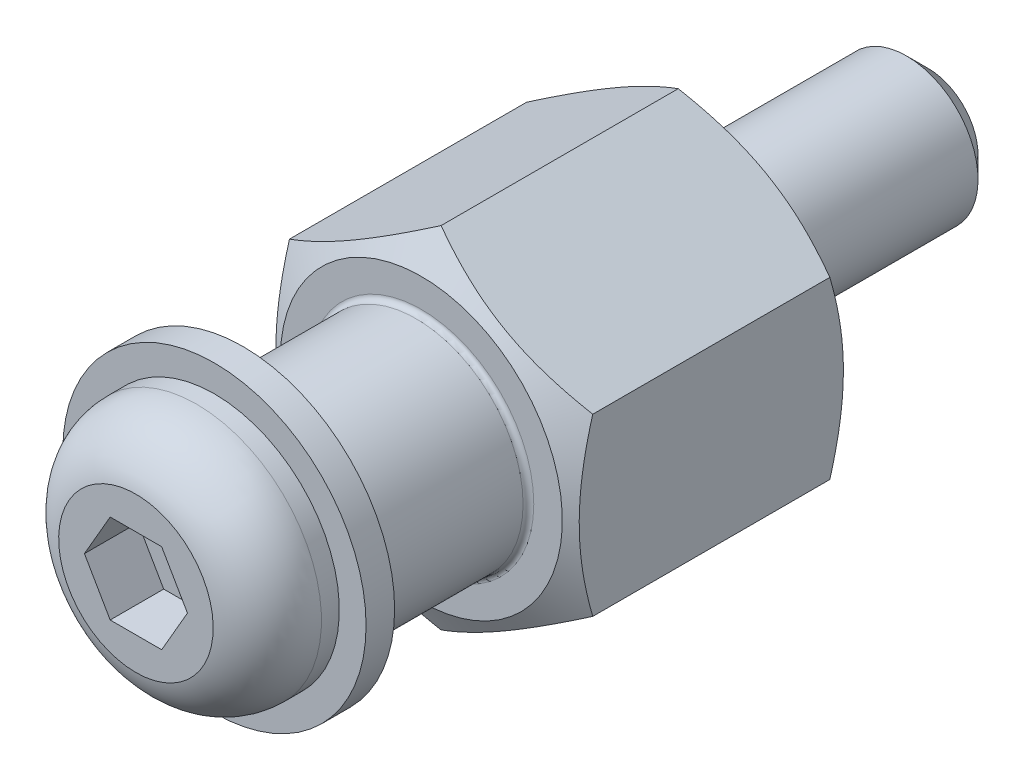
ISO-10303-21;
HEADER;
FILE_DESCRIPTION(('STEP AP214'),'2;1');
FILE_NAME('part.step','',(''),(''),'','','');
FILE_SCHEMA(('AUTOMOTIVE_DESIGN { 1 0 10303 214 1 1 1 1 }'));
ENDSEC;
DATA;
#1=APPLICATION_CONTEXT('core data for automotive mechanical design processes');
#2=APPLICATION_PROTOCOL_DEFINITION('international standard','automotive_design',2000,#1);
#3=PRODUCT_CONTEXT('',#1,'mechanical');
#4=PRODUCT('Part','Part','',(#3));
#5=PRODUCT_RELATED_PRODUCT_CATEGORY('part','',(#4));
#6=PRODUCT_DEFINITION_FORMATION('','',#4);
#7=PRODUCT_DEFINITION_CONTEXT('part definition',#1,'design');
#8=PRODUCT_DEFINITION('design','',#6,#7);
#9=PRODUCT_DEFINITION_SHAPE('','',#8);
#10=(LENGTH_UNIT() NAMED_UNIT(*) SI_UNIT(.MILLI.,.METRE.));
#11=(NAMED_UNIT(*) PLANE_ANGLE_UNIT() SI_UNIT($,.RADIAN.));
#12=(NAMED_UNIT(*) SI_UNIT($,.STERADIAN.) SOLID_ANGLE_UNIT());
#13=UNCERTAINTY_MEASURE_WITH_UNIT(LENGTH_MEASURE(1.E-05),#10,'distance_accuracy_value','');
#14=(GEOMETRIC_REPRESENTATION_CONTEXT(3) GLOBAL_UNCERTAINTY_ASSIGNED_CONTEXT((#13)) GLOBAL_UNIT_ASSIGNED_CONTEXT((#10,
#11,#12)) REPRESENTATION_CONTEXT('',''));
#15=CARTESIAN_POINT('',(0.,0.,0.));
#16=DIRECTION('',(0.,0.,1.));
#17=DIRECTION('',(1.,0.,0.));
#18=AXIS2_PLACEMENT_3D('',#15,#16,#17);
#19=CARTESIAN_POINT('',(0.,-10.8149545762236,25.));
#20=DIRECTION('',(-0.5,-0.866025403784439,0.));
#21=DIRECTION('',(-0.866025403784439,0.5,0.));
#22=AXIS2_PLACEMENT_3D('',#19,#20,#21);
#23=PLANE('',#22);
#24=DIRECTION('',(0.,0.,-1.));
#25=VECTOR('',#24,1.);
#26=CARTESIAN_POINT('',(-8.5,-5.90747728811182,25.));
#27=LINE('',#26,#25);
#28=CARTESIAN_POINT('',(-8.5,-5.90747728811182,14.3944004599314));
#29=VERTEX_POINT('',#28);
#30=CARTESIAN_POINT('',(-8.5,-5.90747728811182,1.10559954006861));
#31=VERTEX_POINT('',#30);
#32=EDGE_CURVE('E126',#29,#31,#27,.T.);
#33=ORIENTED_EDGE('',*,*,#32,.T.);
#34=CARTESIAN_POINT('',(-8.5002,-5.90736181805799,1.10566620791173));
#35=CARTESIAN_POINT('',(-8.31336077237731,-6.01523349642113,1.04339630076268));
#36=CARTESIAN_POINT('',(-8.1258249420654,-6.12350735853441,0.983952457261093));
#37=CARTESIAN_POINT('',(-7.74923024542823,-6.34093440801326,0.871495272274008));
#38=CARTESIAN_POINT('',(-7.56017075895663,-6.45008795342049,0.818484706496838));
#39=CARTESIAN_POINT('',(-6.9899652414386,-6.77929626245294,0.67014355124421));
#40=CARTESIAN_POINT('',(-6.60656835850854,-7.00065055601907,0.585769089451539));
#41=CARTESIAN_POINT('',(-6.03282233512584,-7.33190297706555,0.486830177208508));
#42=CARTESIAN_POINT('',(-5.84418723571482,-7.44081150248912,0.458645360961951));
#43=CARTESIAN_POINT('',(-5.4660639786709,-7.65912106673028,0.411384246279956));
#44=CARTESIAN_POINT('',(-5.27657589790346,-7.76852206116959,0.392307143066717));
#45=CARTESIAN_POINT('',(-4.8972734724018,-7.98751241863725,0.363744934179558));
#46=CARTESIAN_POINT('',(-4.70745974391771,-8.09710142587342,0.354248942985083));
#47=CARTESIAN_POINT('',(-4.32765694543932,-8.3163806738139,0.345052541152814));
#48=CARTESIAN_POINT('',(-4.13766788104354,-8.42607091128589,0.345351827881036));
#49=CARTESIAN_POINT('',(-3.78247698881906,-8.63114046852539,0.355064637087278));
#50=CARTESIAN_POINT('',(-3.6172500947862,-8.72653426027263,0.363293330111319));
#51=CARTESIAN_POINT('',(-3.28718328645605,-8.9170984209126,0.386999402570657));
#52=CARTESIAN_POINT('',(-3.12234339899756,-9.01226877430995,0.402477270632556));
#53=CARTESIAN_POINT('',(-2.62846189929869,-9.29741139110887,0.4594187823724));
#54=CARTESIAN_POINT('',(-2.30029449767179,-9.48687892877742,0.511383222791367));
#55=CARTESIAN_POINT('',(-1.64047857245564,-9.86782383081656,0.6412951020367));
#56=CARTESIAN_POINT('',(-1.30891425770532,-10.0592525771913,0.719793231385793));
#57=CARTESIAN_POINT('',(-0.650730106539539,-10.4392553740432,0.897951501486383));
#58=CARTESIAN_POINT('',(-0.324101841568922,-10.627834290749,0.997569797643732));
#59=CARTESIAN_POINT('',(0.000199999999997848,-10.8150700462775,1.10566620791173));
#60=B_SPLINE_CURVE_WITH_KNOTS('',3,(#34,#35,#36,#37,#38,#39,#40,#41,#42,#43,#44,#45,#46,#47,#48,
#49,#50,#51,#52,#53,#54,#55,#56,#57,#58,#59),.UNSPECIFIED.,.F.,.F.,(4,2,2,2,2,2,2,2,2,2,2,2,4),
(0.,0.673596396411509,1.34748239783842,2.69805431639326,3.35679995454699,4.01548737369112,
4.67342558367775,5.33134346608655,5.90409556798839,6.47688628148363,7.62328361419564,
8.79510569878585,9.9646274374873),.UNSPECIFIED.);
#61=CARTESIAN_POINT('',(0.,-10.8149545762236,1.10559954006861));
#62=VERTEX_POINT('',#61);
#63=EDGE_CURVE('E29',#31,#62,#60,.T.);
#64=ORIENTED_EDGE('',*,*,#63,.T.);
#65=DIRECTION('',(0.,0.,-1.));
#66=VECTOR('',#65,1.);
#67=CARTESIAN_POINT('',(0.,-10.8149545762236,25.));
#68=LINE('',#67,#66);
#69=CARTESIAN_POINT('',(0.,-10.8149545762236,14.3944004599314));
#70=VERTEX_POINT('',#69);
#71=EDGE_CURVE('E131',#70,#62,#68,.T.);
#72=ORIENTED_EDGE('',*,*,#71,.F.);
#73=CARTESIAN_POINT('',(-8.5002,-5.90736181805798,14.3943337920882));
#74=CARTESIAN_POINT('',(-8.31336077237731,-6.01523349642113,14.4566036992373));
#75=CARTESIAN_POINT('',(-8.1258249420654,-6.12350735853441,14.5160475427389));
#76=CARTESIAN_POINT('',(-7.74923024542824,-6.34093440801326,14.628504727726));
#77=CARTESIAN_POINT('',(-7.56017075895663,-6.45008795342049,14.6815152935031));
#78=CARTESIAN_POINT('',(-6.9899652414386,-6.77929626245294,14.8298564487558));
#79=CARTESIAN_POINT('',(-6.60656835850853,-7.00065055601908,14.9142309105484));
#80=CARTESIAN_POINT('',(-6.03282233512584,-7.33190297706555,15.0131698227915));
#81=CARTESIAN_POINT('',(-5.84418723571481,-7.44081150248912,15.041354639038));
#82=CARTESIAN_POINT('',(-5.46606397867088,-7.65912106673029,15.08861575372));
#83=CARTESIAN_POINT('',(-5.27657589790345,-7.76852206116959,15.1076928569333));
#84=CARTESIAN_POINT('',(-4.89727347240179,-7.98751241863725,15.1362550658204));
#85=CARTESIAN_POINT('',(-4.7074597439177,-8.09710142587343,15.1457510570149));
#86=CARTESIAN_POINT('',(-4.32765694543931,-8.3163806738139,15.1549474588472));
#87=CARTESIAN_POINT('',(-4.13766788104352,-8.4260709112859,15.154648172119));
#88=CARTESIAN_POINT('',(-3.78247698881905,-8.6311404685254,15.1449353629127));
#89=CARTESIAN_POINT('',(-3.6172500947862,-8.72653426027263,15.1367066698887));
#90=CARTESIAN_POINT('',(-3.28718328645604,-8.91709842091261,15.1130005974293));
#91=CARTESIAN_POINT('',(-3.12234339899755,-9.01226877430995,15.0975227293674));
#92=CARTESIAN_POINT('',(-2.62846189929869,-9.29741139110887,15.0405812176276));
#93=CARTESIAN_POINT('',(-2.30029449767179,-9.48687892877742,14.9886167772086));
#94=CARTESIAN_POINT('',(-1.64047857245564,-9.86782383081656,14.8587048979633));
#95=CARTESIAN_POINT('',(-1.30891425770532,-10.0592525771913,14.7802067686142));
#96=CARTESIAN_POINT('',(-0.650730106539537,-10.4392553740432,14.6020484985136));
#97=CARTESIAN_POINT('',(-0.324101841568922,-10.627834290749,14.5024302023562));
#98=CARTESIAN_POINT('',(0.000199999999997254,-10.8150700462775,14.3943337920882));
#99=B_SPLINE_CURVE_WITH_KNOTS('',3,(#73,#74,#75,#76,#77,#78,#79,#80,#81,#82,#83,#84,#85,#86,#87,
#88,#89,#90,#91,#92,#93,#94,#95,#96,#97,#98),.UNSPECIFIED.,.F.,.F.,(4,2,2,2,2,2,2,2,2,2,2,2,4),
(0.,0.673596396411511,1.34748239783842,2.69805431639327,3.35679995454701,4.01548737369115,
4.67342558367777,5.33134346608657,5.90409556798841,6.47688628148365,7.62328361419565,
8.79510569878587,9.96462743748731),.UNSPECIFIED.);
#100=EDGE_CURVE('E202',#29,#70,#99,.T.);
#101=ORIENTED_EDGE('',*,*,#100,.F.);
#102=EDGE_LOOP('',(#33,#64,#72,#101));
#103=FACE_BOUND('',#102,.T.);
#104=ADVANCED_FACE('F14',(#103),#23,.T.);
#105=CARTESIAN_POINT('',(8.5,-5.90747728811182,25.));
#106=DIRECTION('',(0.5,-0.866025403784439,0.));
#107=DIRECTION('',(-0.866025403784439,-0.5,0.));
#108=AXIS2_PLACEMENT_3D('',#105,#106,#107);
#109=PLANE('',#108);
#110=ORIENTED_EDGE('',*,*,#71,.T.);
#111=CARTESIAN_POINT('',(-0.000200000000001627,-10.8150700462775,1.10566620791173));
#112=CARTESIAN_POINT('',(0.186639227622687,-10.7071983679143,1.04339630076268));
#113=CARTESIAN_POINT('',(0.374175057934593,-10.5989245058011,0.983952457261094));
#114=CARTESIAN_POINT('',(0.750769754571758,-10.3814974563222,0.871495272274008));
#115=CARTESIAN_POINT('',(0.939829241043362,-10.272343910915,0.818484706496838));
#116=CARTESIAN_POINT('',(1.51003475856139,-9.94313560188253,0.670143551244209));
#117=CARTESIAN_POINT('',(1.89343164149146,-9.72178130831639,0.585769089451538));
#118=CARTESIAN_POINT('',(2.46717766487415,-9.39052888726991,0.486830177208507));
#119=CARTESIAN_POINT('',(2.65581276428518,-9.28162036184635,0.45864536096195));
#120=CARTESIAN_POINT('',(3.0339360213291,-9.06331079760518,0.411384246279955));
#121=CARTESIAN_POINT('',(3.22342410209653,-8.95390980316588,0.392307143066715));
#122=CARTESIAN_POINT('',(3.60272652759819,-8.73491944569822,0.363744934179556));
#123=CARTESIAN_POINT('',(3.79254025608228,-8.62533043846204,0.354248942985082));
#124=CARTESIAN_POINT('',(4.17234305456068,-8.40605119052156,0.345052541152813));
#125=CARTESIAN_POINT('',(4.36233211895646,-8.29636095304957,0.345351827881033));
#126=CARTESIAN_POINT('',(4.71752301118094,-8.09129139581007,0.355064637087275));
#127=CARTESIAN_POINT('',(4.88274990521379,-7.99589760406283,0.363293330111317));
#128=CARTESIAN_POINT('',(5.21281671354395,-7.80533344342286,0.386999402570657));
#129=CARTESIAN_POINT('',(5.37765660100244,-7.71016309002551,0.402477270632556));
#130=CARTESIAN_POINT('',(5.87153810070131,-7.42502047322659,0.459418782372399));
#131=CARTESIAN_POINT('',(6.19970550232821,-7.23555293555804,0.511383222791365));
#132=CARTESIAN_POINT('',(6.85952142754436,-6.8546080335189,0.641295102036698));
#133=CARTESIAN_POINT('',(7.19108574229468,-6.66317928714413,0.719793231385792));
#134=CARTESIAN_POINT('',(7.84926989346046,-6.28317649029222,0.897951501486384));
#135=CARTESIAN_POINT('',(8.17589815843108,-6.09459757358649,0.997569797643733));
#136=CARTESIAN_POINT('',(8.5002,-5.90736181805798,1.10566620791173));
#137=B_SPLINE_CURVE_WITH_KNOTS('',3,(#111,#112,#113,#114,#115,#116,#117,#118,#119,#120,#121,
#122,#123,#124,#125,#126,#127,#128,#129,#130,#131,#132,#133,#134,#135,#136),.UNSPECIFIED.,.F.,
.F.,(4,2,2,2,2,2,2,2,2,2,2,2,4),(0.,0.673596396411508,1.34748239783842,2.69805431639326,
3.35679995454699,4.01548737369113,4.67342558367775,5.33134346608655,5.9040955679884,
6.47688628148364,7.62328361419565,8.79510569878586,9.96462743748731),.UNSPECIFIED.);
#138=CARTESIAN_POINT('',(8.5,-5.90747728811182,1.10559954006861));
#139=VERTEX_POINT('',#138);
#140=EDGE_CURVE('E244',#62,#139,#137,.T.);
#141=ORIENTED_EDGE('',*,*,#140,.T.);
#142=DIRECTION('',(0.,0.,-1.));
#143=VECTOR('',#142,1.);
#144=CARTESIAN_POINT('',(8.5,-5.90747728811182,25.));
#145=LINE('',#144,#143);
#146=CARTESIAN_POINT('',(8.5,-5.90747728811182,14.3944004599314));
#147=VERTEX_POINT('',#146);
#148=EDGE_CURVE('E139',#147,#139,#145,.T.);
#149=ORIENTED_EDGE('',*,*,#148,.F.);
#150=CARTESIAN_POINT('',(-0.000200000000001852,-10.8150700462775,14.3943337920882));
#151=CARTESIAN_POINT('',(0.186639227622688,-10.7071983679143,14.4566036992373));
#152=CARTESIAN_POINT('',(0.374175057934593,-10.5989245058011,14.5160475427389));
#153=CARTESIAN_POINT('',(0.750769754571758,-10.3814974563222,14.628504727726));
#154=CARTESIAN_POINT('',(0.939829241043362,-10.272343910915,14.6815152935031));
#155=CARTESIAN_POINT('',(1.5100347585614,-9.94313560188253,14.8298564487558));
#156=CARTESIAN_POINT('',(1.89343164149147,-9.72178130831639,14.9142309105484));
#157=CARTESIAN_POINT('',(2.46717766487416,-9.39052888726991,15.0131698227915));
#158=CARTESIAN_POINT('',(2.65581276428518,-9.28162036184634,15.041354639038));
#159=CARTESIAN_POINT('',(3.03393602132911,-9.06331079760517,15.08861575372));
#160=CARTESIAN_POINT('',(3.22342410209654,-8.95390980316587,15.1076928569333));
#161=CARTESIAN_POINT('',(3.6027265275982,-8.73491944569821,15.1362550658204));
#162=CARTESIAN_POINT('',(3.79254025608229,-8.62533043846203,15.1457510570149));
#163=CARTESIAN_POINT('',(4.17234305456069,-8.40605119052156,15.1549474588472));
#164=CARTESIAN_POINT('',(4.36233211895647,-8.29636095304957,15.154648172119));
#165=CARTESIAN_POINT('',(4.71752301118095,-8.09129139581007,15.1449353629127));
#166=CARTESIAN_POINT('',(4.8827499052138,-7.99589760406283,15.1367066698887));
#167=CARTESIAN_POINT('',(5.21281671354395,-7.80533344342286,15.1130005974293));
#168=CARTESIAN_POINT('',(5.37765660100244,-7.71016309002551,15.0975227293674));
#169=CARTESIAN_POINT('',(5.87153810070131,-7.42502047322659,15.0405812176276));
#170=CARTESIAN_POINT('',(6.19970550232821,-7.23555293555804,14.9886167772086));
#171=CARTESIAN_POINT('',(6.85952142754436,-6.8546080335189,14.8587048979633));
#172=CARTESIAN_POINT('',(7.19108574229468,-6.66317928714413,14.7802067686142));
#173=CARTESIAN_POINT('',(7.84926989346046,-6.28317649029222,14.6020484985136));
#174=CARTESIAN_POINT('',(8.17589815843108,-6.09459757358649,14.5024302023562));
#175=CARTESIAN_POINT('',(8.5002,-5.90736181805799,14.3943337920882));
#176=B_SPLINE_CURVE_WITH_KNOTS('',3,(#150,#151,#152,#153,#154,#155,#156,#157,#158,#159,#160,
#161,#162,#163,#164,#165,#166,#167,#168,#169,#170,#171,#172,#173,#174,#175),.UNSPECIFIED.,.F.,
.F.,(4,2,2,2,2,2,2,2,2,2,2,2,4),(0.,0.673596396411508,1.34748239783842,2.69805431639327,
3.35679995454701,4.01548737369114,4.67342558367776,5.33134346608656,5.9040955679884,
6.47688628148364,7.62328361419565,8.79510569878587,9.96462743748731),.UNSPECIFIED.);
#177=EDGE_CURVE('E195',#70,#147,#176,.T.);
#178=ORIENTED_EDGE('',*,*,#177,.F.);
#179=EDGE_LOOP('',(#110,#141,#149,#178));
#180=FACE_BOUND('',#179,.T.);
#181=ADVANCED_FACE('F253',(#180),#109,.T.);
#182=CARTESIAN_POINT('',(8.5,3.90747728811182,25.));
#183=DIRECTION('',(1.,0.,0.));
#184=DIRECTION('',(0.,-1.,0.));
#185=AXIS2_PLACEMENT_3D('',#182,#183,#184);
#186=PLANE('',#185);
#187=ORIENTED_EDGE('',*,*,#148,.T.);
#188=CARTESIAN_POINT('',(8.5,-14.1315309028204,4.47012149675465));
#189=CARTESIAN_POINT('',(8.49999999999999,-13.760691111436,4.29043483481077));
#190=CARTESIAN_POINT('',(8.49999999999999,-13.3889945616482,4.11248581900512));
#191=CARTESIAN_POINT('',(8.49999999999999,-12.6434320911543,3.76104143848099));
#192=CARTESIAN_POINT('',(8.49999999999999,-12.2695658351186,3.58754678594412));
#193=CARTESIAN_POINT('',(8.49999999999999,-11.5172575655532,3.24510584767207));
#194=CARTESIAN_POINT('',(8.49999999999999,-11.1388016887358,3.07618991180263));
#195=CARTESIAN_POINT('',(8.49999999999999,-10.3788620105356,2.74533888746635));
#196=CARTESIAN_POINT('',(8.49999999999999,-9.9973783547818,2.58340346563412));
#197=CARTESIAN_POINT('',(8.49999999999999,-9.21867965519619,2.26338706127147));
#198=CARTESIAN_POINT('',(8.49999999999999,-8.82134785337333,2.10558860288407));
#199=CARTESIAN_POINT('',(8.49999999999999,-8.02201813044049,1.80205731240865));
#200=CARTESIAN_POINT('',(8.49999999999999,-7.62001968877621,1.65632584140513));
#201=CARTESIAN_POINT('',(8.49999999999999,-6.81148108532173,1.38079167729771));
#202=CARTESIAN_POINT('',(8.49999999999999,-6.40495218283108,1.25095630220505));
#203=CARTESIAN_POINT('',(8.5,-5.58607825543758,1.01141191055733));
#204=CARTESIAN_POINT('',(8.5,-5.17373512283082,0.901696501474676));
#205=CARTESIAN_POINT('',(8.5,-4.34519756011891,0.708275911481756));
#206=CARTESIAN_POINT('',(8.5,-3.92903635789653,0.624432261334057));
#207=CARTESIAN_POINT('',(8.5,-3.30104574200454,0.521728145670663));
#208=CARTESIAN_POINT('',(8.5,-3.091074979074,0.491335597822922));
#209=CARTESIAN_POINT('',(8.5,-2.6701070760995,0.438834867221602));
#210=CARTESIAN_POINT('',(8.5,-2.45911003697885,0.416725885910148));
#211=CARTESIAN_POINT('',(8.5,-2.03910690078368,0.381507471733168));
#212=CARTESIAN_POINT('',(8.5,-1.83011027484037,0.36828552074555));
#213=CARTESIAN_POINT('',(8.5,-1.41174540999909,0.350687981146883));
#214=CARTESIAN_POINT('',(8.5,-1.20237717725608,0.346312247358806));
#215=CARTESIAN_POINT('',(8.5,-0.783642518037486,0.346511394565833));
#216=CARTESIAN_POINT('',(8.5,-0.574276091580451,0.351086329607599));
#217=CARTESIAN_POINT('',(8.5,-0.155920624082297,0.36907590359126));
#218=CARTESIAN_POINT('',(8.5,0.053068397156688,0.38249099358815));
#219=CARTESIAN_POINT('',(8.5,0.556859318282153,0.425202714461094));
#220=CARTESIAN_POINT('',(8.5,0.851305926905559,0.458778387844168));
#221=CARTESIAN_POINT('',(8.5,1.43796669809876,0.541634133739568));
#222=CARTESIAN_POINT('',(8.5,1.73018054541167,0.590916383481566));
#223=CARTESIAN_POINT('',(8.5,2.60316411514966,0.759705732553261));
#224=CARTESIAN_POINT('',(8.5,3.17994168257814,0.900123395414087));
#225=CARTESIAN_POINT('',(8.5,4.04234497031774,1.14303572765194));
#226=CARTESIAN_POINT('',(8.5,4.33245803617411,1.23051021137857));
#227=CARTESIAN_POINT('',(8.5,4.90986519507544,1.41439752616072));
#228=CARTESIAN_POINT('',(8.5,5.19715926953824,1.51081041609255));
#229=CARTESIAN_POINT('',(8.5,5.76902201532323,1.71103979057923));
#230=CARTESIAN_POINT('',(8.5,6.05359158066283,1.81485374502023));
#231=CARTESIAN_POINT('',(8.5,6.62038249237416,2.02867839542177));
#232=CARTESIAN_POINT('',(8.5,6.90260386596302,2.13868901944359));
#233=CARTESIAN_POINT('',(8.5,7.56775332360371,2.40503594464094));
#234=CARTESIAN_POINT('',(8.5,7.94978486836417,2.56360702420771));
#235=CARTESIAN_POINT('',(8.5,8.71062153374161,2.88833121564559));
#236=CARTESIAN_POINT('',(8.5,9.08942645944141,3.05448478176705));
#237=CARTESIAN_POINT('',(8.5,9.84441155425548,3.39285509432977));
#238=CARTESIAN_POINT('',(8.5,10.2205911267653,3.56507316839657));
#239=CARTESIAN_POINT('',(8.5,10.9706812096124,3.91434986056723));
#240=CARTESIAN_POINT('',(8.5,11.3445917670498,4.09140837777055));
#241=CARTESIAN_POINT('',(8.5,12.0909240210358,4.44965322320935));
#242=CARTESIAN_POINT('',(8.50000000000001,12.4633436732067,4.63084380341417));
#243=CARTESIAN_POINT('',(8.50000000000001,13.2065873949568,4.99646713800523));
#244=CARTESIAN_POINT('',(8.50000000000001,13.577411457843,5.18089990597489));
#245=CARTESIAN_POINT('',(8.50000000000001,14.6877781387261,5.73815327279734));
#246=CARTESIAN_POINT('',(8.50000000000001,15.4253120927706,6.11497580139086));
#247=CARTESIAN_POINT('',(8.50000000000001,16.8349594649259,6.84429507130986));
#248=CARTESIAN_POINT('',(8.50000000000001,17.5073853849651,7.19619047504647));
#249=CARTESIAN_POINT('',(8.50000000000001,18.8497549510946,7.90473738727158));
#250=CARTESIAN_POINT('',(8.50000000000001,19.5196985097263,8.26138906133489));
#251=CARTESIAN_POINT('',(8.50000000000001,20.8560043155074,8.9774338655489));
#252=CARTESIAN_POINT('',(8.50000000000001,21.5223713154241,9.33681813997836));
#253=CARTESIAN_POINT('',(8.50000000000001,22.8535183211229,10.0584290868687));
#254=CARTESIAN_POINT('',(8.50000000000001,23.5182984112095,10.420655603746));
#255=CARTESIAN_POINT('',(8.5,24.1824942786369,10.7839431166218));
#256=B_SPLINE_CURVE_WITH_KNOTS('',3,(#188,#189,#190,#191,#192,#193,#194,#195,#196,#197,#198,
#199,#200,#201,#202,#203,#204,#205,#206,#207,#208,#209,#210,#211,#212,#213,#214,#215,#216,#217,
#218,#219,#220,#221,#222,#223,#224,#225,#226,#227,#228,#229,#230,#231,#232,#233,#234,#235,#236,
#237,#238,#239,#240,#241,#242,#243,#244,#245,#246,#247,#248,#249,#250,#251,#252,#253,#254,#255),
.UNSPECIFIED.,.F.,.F.,(4,2,2,2,2,2,2,2,2,2,2,2,2,2,2,2,2,2,2,2,2,2,2,2,2,2,2,2,2,2,2,2,2,4),(0.,
1.23625359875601,2.47270363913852,3.71597054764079,4.95917801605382,6.24158443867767,
7.5241353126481,8.80400336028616,10.0834640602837,11.3559531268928,11.9922923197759,
12.6285701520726,13.2566322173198,13.8846839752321,14.5127395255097,15.1408271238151,
16.0293882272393,16.9180725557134,18.6964438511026,19.6054113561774,20.5143848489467,
21.4230490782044,22.3317027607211,23.5724936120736,24.8133588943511,26.0544975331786,
27.2956103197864,28.5380636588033,29.7805222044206,32.2651165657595,34.5419104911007,
36.8187838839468,39.0900797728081,41.3612521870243),.UNSPECIFIED.);
#257=CARTESIAN_POINT('',(8.5,3.90747728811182,1.10559954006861));
#258=VERTEX_POINT('',#257);
#259=EDGE_CURVE('E237',#139,#258,#256,.T.);
#260=ORIENTED_EDGE('',*,*,#259,.T.);
#261=DIRECTION('',(0.,0.,-1.));
#262=VECTOR('',#261,1.);
#263=CARTESIAN_POINT('',(8.5,3.90747728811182,25.));
#264=LINE('',#263,#262);
#265=CARTESIAN_POINT('',(8.5,3.90747728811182,14.3944004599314));
#266=VERTEX_POINT('',#265);
#267=EDGE_CURVE('E142',#266,#258,#264,.T.);
#268=ORIENTED_EDGE('',*,*,#267,.F.);
#269=CARTESIAN_POINT('',(8.5,-14.1992887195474,10.9970131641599));
#270=CARTESIAN_POINT('',(8.49999999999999,-13.8278219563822,11.1772769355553));
#271=CARTESIAN_POINT('',(8.49999999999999,-13.4555041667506,11.355816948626));
#272=CARTESIAN_POINT('',(8.49999999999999,-12.7087138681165,11.7084800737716));
#273=CARTESIAN_POINT('',(8.49999999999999,-12.3342410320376,11.8826024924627));
#274=CARTESIAN_POINT('',(8.49999999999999,-11.5807676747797,12.2263329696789));
#275=CARTESIAN_POINT('',(8.49999999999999,-11.2017536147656,12.3959114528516));
#276=CARTESIAN_POINT('',(8.49999999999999,-10.4407161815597,12.728149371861));
#277=CARTESIAN_POINT('',(8.49999999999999,-10.0586929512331,12.8908091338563));
#278=CARTESIAN_POINT('',(8.49999999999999,-9.27878039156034,13.2124342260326));
#279=CARTESIAN_POINT('',(8.49999999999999,-8.88077360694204,13.371116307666));
#280=CARTESIAN_POINT('',(8.49999999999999,-8.08011143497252,13.6765124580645));
#281=CARTESIAN_POINT('',(8.49999999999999,-7.67745553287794,13.8232251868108));
#282=CARTESIAN_POINT('',(8.49999999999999,-6.86759699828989,14.1008444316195));
#283=CARTESIAN_POINT('',(8.49999999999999,-6.46040538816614,14.2317827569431));
#284=CARTESIAN_POINT('',(8.5,-5.64019672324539,14.4736654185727));
#285=CARTESIAN_POINT('',(8.5,-5.22718154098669,14.5846160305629));
#286=CARTESIAN_POINT('',(8.5,-4.39724117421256,14.7806318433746));
#287=CARTESIAN_POINT('',(8.5,-3.98034909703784,14.8658334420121));
#288=CARTESIAN_POINT('',(8.5,-3.3512017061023,14.9706267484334));
#289=CARTESIAN_POINT('',(8.5,-3.14083615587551,15.0017243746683));
#290=CARTESIAN_POINT('',(8.5,-2.71905357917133,15.055640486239));
#291=CARTESIAN_POINT('',(8.5,-2.50763665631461,15.0784597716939));
#292=CARTESIAN_POINT('',(8.5,-2.08680596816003,15.1150773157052));
#293=CARTESIAN_POINT('',(8.5,-1.87740216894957,15.1289896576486));
#294=CARTESIAN_POINT('',(8.5,-1.45819388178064,15.1479458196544));
#295=CARTESIAN_POINT('',(8.5,-1.24838940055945,15.1529897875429));
#296=CARTESIAN_POINT('',(8.5,-0.828752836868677,15.1540888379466));
#297=CARTESIAN_POINT('',(8.5,-0.618920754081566,15.1501438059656));
#298=CARTESIAN_POINT('',(8.5,-0.199609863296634,15.1333613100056));
#299=CARTESIAN_POINT('',(8.5,0.00986892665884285,15.1205234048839));
#300=CARTESIAN_POINT('',(8.5,0.512663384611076,15.0793090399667));
#301=CARTESIAN_POINT('',(8.5,0.805643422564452,15.0467494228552));
#302=CARTESIAN_POINT('',(8.5,1.38942762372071,14.9660059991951));
#303=CARTESIAN_POINT('',(8.5,1.68023148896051,14.9178200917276));
#304=CARTESIAN_POINT('',(8.5,2.54903649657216,14.75237838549));
#305=CARTESIAN_POINT('',(8.5,3.12311876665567,14.6142675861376));
#306=CARTESIAN_POINT('',(8.5,3.98179883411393,14.3747233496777));
#307=CARTESIAN_POINT('',(8.5,4.27084512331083,14.2883198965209));
#308=CARTESIAN_POINT('',(8.5,4.84612899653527,14.1065368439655));
#309=CARTESIAN_POINT('',(8.5,5.13236655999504,14.0111571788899));
#310=CARTESIAN_POINT('',(8.5,5.70212651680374,13.8129526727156));
#311=CARTESIAN_POINT('',(8.5,5.98564974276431,13.7101302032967));
#312=CARTESIAN_POINT('',(8.5,6.55034329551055,13.4982504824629));
#313=CARTESIAN_POINT('',(8.5,6.83151366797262,13.3891933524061));
#314=CARTESIAN_POINT('',(8.5,7.56514985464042,13.0967801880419));
#315=CARTESIAN_POINT('',(8.5,8.01593501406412,12.9092123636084));
#316=CARTESIAN_POINT('',(8.5,8.91311557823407,12.5238221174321));
#317=CARTESIAN_POINT('',(8.5,9.35951056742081,12.3259987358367));
#318=CARTESIAN_POINT('',(8.5,10.24887669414,11.9224423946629));
#319=CARTESIAN_POINT('',(8.5,10.6918466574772,11.7167068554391));
#320=CARTESIAN_POINT('',(8.5,11.5748818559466,11.2991506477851));
#321=CARTESIAN_POINT('',(8.50000000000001,12.0149471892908,11.0873301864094));
#322=CARTESIAN_POINT('',(8.50000000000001,12.8933564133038,10.6585802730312));
#323=CARTESIAN_POINT('',(8.50000000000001,13.3316969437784,10.4416439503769));
#324=CARTESIAN_POINT('',(8.50000000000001,14.2064516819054,10.0039202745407));
#325=CARTESIAN_POINT('',(8.50000000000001,14.6428658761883,9.78313289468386));
#326=CARTESIAN_POINT('',(8.50000000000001,15.5140190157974,9.33848353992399));
#327=CARTESIAN_POINT('',(8.50000000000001,15.9487582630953,9.11462215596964));
#328=CARTESIAN_POINT('',(8.50000000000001,16.8169110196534,8.66434192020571));
#329=CARTESIAN_POINT('',(8.50000000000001,17.2503245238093,8.43792305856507));
#330=CARTESIAN_POINT('',(8.50000000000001,18.4623626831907,7.8009824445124));
#331=CARTESIAN_POINT('',(8.50000000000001,19.239746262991,7.38809942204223));
#332=CARTESIAN_POINT('',(8.50000000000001,20.7918868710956,6.55733919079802));
#333=CARTESIAN_POINT('',(8.50000000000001,21.5666437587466,6.13946171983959));
#334=CARTESIAN_POINT('',(8.50000000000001,23.1117775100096,5.30123247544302));
#335=CARTESIAN_POINT('',(8.50000000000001,23.8821605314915,4.88089204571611));
#336=CARTESIAN_POINT('',(8.50000000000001,25.0365272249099,4.24824332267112));
#337=CARTESIAN_POINT('',(8.50000000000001,25.4211015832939,4.0370113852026));
#338=CARTESIAN_POINT('',(8.50000000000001,26.1898980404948,3.61390853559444));
#339=CARTESIAN_POINT('',(8.50000000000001,26.5741201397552,3.40203762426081));
#340=CARTESIAN_POINT('',(8.5,26.9581873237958,3.18988619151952));
#341=B_SPLINE_CURVE_WITH_KNOTS('',3,(#269,#270,#271,#272,#273,#274,#275,#276,#277,#278,#279,
#280,#281,#282,#283,#284,#285,#286,#287,#288,#289,#290,#291,#292,#293,#294,#295,#296,#297,#298,
#299,#300,#301,#302,#303,#304,#305,#306,#307,#308,#309,#310,#311,#312,#313,#314,#315,#316,#317,
#318,#319,#320,#321,#322,#323,#324,#325,#326,#327,#328,#329,#330,#331,#332,#333,#334,#335,#336,
#337,#338,#339,#340),.UNSPECIFIED.,.F.,.F.,(4,2,2,2,2,2,2,2,2,2,2,2,2,2,2,2,2,2,2,2,2,2,2,2,2,2,
2,2,2,2,2,2,2,2,2,4),(0.,1.23870114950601,2.47759553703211,3.72320326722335,4.96875221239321,
6.25402283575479,7.53943715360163,8.82221442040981,10.1045882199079,11.3800448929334,
12.0178626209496,12.6556186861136,13.2850334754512,13.9144377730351,14.5438500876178,
15.1732936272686,16.0571460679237,16.9411173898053,18.7099966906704,19.6149731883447,
20.519956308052,21.4246523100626,22.3293307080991,23.7938976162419,25.2586018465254,
26.723787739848,28.1889238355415,29.6561544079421,31.1233951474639,32.5903576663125,
34.0573258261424,36.697975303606,39.3387640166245,41.9715458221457,43.2878459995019,
44.6041445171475),.UNSPECIFIED.);
#342=EDGE_CURVE('E187',#147,#266,#341,.T.);
#343=ORIENTED_EDGE('',*,*,#342,.F.);
#344=EDGE_LOOP('',(#187,#260,#268,#343));
#345=FACE_BOUND('',#344,.T.);
#346=ADVANCED_FACE('F250',(#345),#186,.T.);
#347=CARTESIAN_POINT('',(0.,8.81495457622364,25.));
#348=DIRECTION('',(0.5,0.866025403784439,0.));
#349=DIRECTION('',(0.866025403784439,-0.5,0.));
#350=AXIS2_PLACEMENT_3D('',#347,#348,#349);
#351=PLANE('',#350);
#352=ORIENTED_EDGE('',*,*,#267,.T.);
#353=CARTESIAN_POINT('',(8.5002,3.90736181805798,1.10566620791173));
#354=CARTESIAN_POINT('',(8.31336077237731,4.01523349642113,1.04339630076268));
#355=CARTESIAN_POINT('',(8.1258249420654,4.12350735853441,0.983952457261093));
#356=CARTESIAN_POINT('',(7.74923024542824,4.34093440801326,0.871495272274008));
#357=CARTESIAN_POINT('',(7.56017075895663,4.45008795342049,0.818484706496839));
#358=CARTESIAN_POINT('',(6.9899652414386,4.77929626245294,0.670143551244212));
#359=CARTESIAN_POINT('',(6.60656835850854,5.00065055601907,0.585769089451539));
#360=CARTESIAN_POINT('',(6.03282233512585,5.33190297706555,0.486830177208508));
#361=CARTESIAN_POINT('',(5.84418723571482,5.44081150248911,0.458645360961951));
#362=CARTESIAN_POINT('',(5.46606397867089,5.65912106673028,0.411384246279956));
#363=CARTESIAN_POINT('',(5.27657589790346,5.76852206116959,0.392307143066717));
#364=CARTESIAN_POINT('',(4.8972734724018,5.98751241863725,0.363744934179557));
#365=CARTESIAN_POINT('',(4.70745974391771,6.09710142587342,0.354248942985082));
#366=CARTESIAN_POINT('',(4.32765694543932,6.3163806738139,0.345052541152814));
#367=CARTESIAN_POINT('',(4.13766788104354,6.42607091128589,0.345351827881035));
#368=CARTESIAN_POINT('',(3.78247698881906,6.63114046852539,0.355064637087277));
#369=CARTESIAN_POINT('',(3.6172500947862,6.72653426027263,0.363293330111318));
#370=CARTESIAN_POINT('',(3.28718328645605,6.9170984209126,0.386999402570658));
#371=CARTESIAN_POINT('',(3.12234339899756,7.01226877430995,0.402477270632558));
#372=CARTESIAN_POINT('',(2.62846189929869,7.29741139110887,0.459418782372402));
#373=CARTESIAN_POINT('',(2.30029449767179,7.48687892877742,0.511383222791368));
#374=CARTESIAN_POINT('',(1.64047857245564,7.86782383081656,0.6412951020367));
#375=CARTESIAN_POINT('',(1.30891425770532,8.05925257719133,0.719793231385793));
#376=CARTESIAN_POINT('',(0.650730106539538,8.43925537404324,0.897951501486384));
#377=CARTESIAN_POINT('',(0.324101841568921,8.62783429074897,0.997569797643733));
#378=CARTESIAN_POINT('',(-0.000199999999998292,8.81507004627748,1.10566620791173));
#379=B_SPLINE_CURVE_WITH_KNOTS('',3,(#353,#354,#355,#356,#357,#358,#359,#360,#361,#362,#363,
#364,#365,#366,#367,#368,#369,#370,#371,#372,#373,#374,#375,#376,#377,#378),.UNSPECIFIED.,.F.,
.F.,(4,2,2,2,2,2,2,2,2,2,2,2,4),(0.,0.673596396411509,1.34748239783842,2.69805431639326,
3.35679995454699,4.01548737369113,4.67342558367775,5.33134346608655,5.90409556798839,
6.47688628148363,7.62328361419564,8.79510569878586,9.9646274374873),.UNSPECIFIED.);
#380=CARTESIAN_POINT('',(0.,8.81495457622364,1.10559954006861));
#381=VERTEX_POINT('',#380);
#382=EDGE_CURVE('E120',#258,#381,#379,.T.);
#383=ORIENTED_EDGE('',*,*,#382,.T.);
#384=DIRECTION('',(0.,0.,-1.));
#385=VECTOR('',#384,1.);
#386=CARTESIAN_POINT('',(0.,8.81495457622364,25.));
#387=LINE('',#386,#385);
#388=CARTESIAN_POINT('',(0.,8.81495457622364,14.3944004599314));
#389=VERTEX_POINT('',#388);
#390=EDGE_CURVE('E119',#389,#381,#387,.T.);
#391=ORIENTED_EDGE('',*,*,#390,.F.);
#392=CARTESIAN_POINT('',(8.5002,3.90736181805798,14.3943337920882));
#393=CARTESIAN_POINT('',(8.31336077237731,4.01523349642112,14.4566036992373));
#394=CARTESIAN_POINT('',(8.12582494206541,4.1235073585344,14.5160475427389));
#395=CARTESIAN_POINT('',(7.74923024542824,4.34093440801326,14.628504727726));
#396=CARTESIAN_POINT('',(7.56017075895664,4.45008795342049,14.6815152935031));
#397=CARTESIAN_POINT('',(6.9899652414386,4.77929626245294,14.8298564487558));
#398=CARTESIAN_POINT('',(6.60656835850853,5.00065055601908,14.9142309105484));
#399=CARTESIAN_POINT('',(6.03282233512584,5.33190297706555,15.0131698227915));
#400=CARTESIAN_POINT('',(5.84418723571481,5.44081150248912,15.041354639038));
#401=CARTESIAN_POINT('',(5.46606397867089,5.65912106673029,15.08861575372));
#402=CARTESIAN_POINT('',(5.27657589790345,5.76852206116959,15.1076928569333));
#403=CARTESIAN_POINT('',(4.8972734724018,5.98751241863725,15.1362550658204));
#404=CARTESIAN_POINT('',(4.7074597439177,6.09710142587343,15.1457510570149));
#405=CARTESIAN_POINT('',(4.32765694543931,6.3163806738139,15.1549474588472));
#406=CARTESIAN_POINT('',(4.13766788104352,6.42607091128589,15.154648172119));
#407=CARTESIAN_POINT('',(3.78247698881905,6.63114046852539,15.1449353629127));
#408=CARTESIAN_POINT('',(3.6172500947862,6.72653426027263,15.1367066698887));
#409=CARTESIAN_POINT('',(3.28718328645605,6.9170984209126,15.1130005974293));
#410=CARTESIAN_POINT('',(3.12234339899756,7.01226877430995,15.0975227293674));
#411=CARTESIAN_POINT('',(2.62846189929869,7.29741139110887,15.0405812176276));
#412=CARTESIAN_POINT('',(2.30029449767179,7.48687892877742,14.9886167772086));
#413=CARTESIAN_POINT('',(1.64047857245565,7.86782383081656,14.8587048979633));
#414=CARTESIAN_POINT('',(1.30891425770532,8.05925257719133,14.7802067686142));
#415=CARTESIAN_POINT('',(0.65073010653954,8.43925537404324,14.6020484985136));
#416=CARTESIAN_POINT('',(0.324101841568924,8.62783429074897,14.5024302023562));
#417=CARTESIAN_POINT('',(-0.000199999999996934,8.81507004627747,14.3943337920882));
#418=B_SPLINE_CURVE_WITH_KNOTS('',3,(#392,#393,#394,#395,#396,#397,#398,#399,#400,#401,#402,
#403,#404,#405,#406,#407,#408,#409,#410,#411,#412,#413,#414,#415,#416,#417),.UNSPECIFIED.,.F.,
.F.,(4,2,2,2,2,2,2,2,2,2,2,2,4),(0.,0.673596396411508,1.34748239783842,2.69805431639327,
3.35679995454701,4.01548737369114,4.67342558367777,5.33134346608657,5.9040955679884,
6.47688628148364,7.62328361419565,8.79510569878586,9.9646274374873),.UNSPECIFIED.);
#419=EDGE_CURVE('E155',#266,#389,#418,.T.);
#420=ORIENTED_EDGE('',*,*,#419,.F.);
#421=EDGE_LOOP('',(#352,#383,#391,#420));
#422=FACE_BOUND('',#421,.T.);
#423=ADVANCED_FACE('F165',(#422),#351,.T.);
#424=CARTESIAN_POINT('',(-8.5,3.90747728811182,25.));
#425=DIRECTION('',(-0.5,0.866025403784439,0.));
#426=DIRECTION('',(0.866025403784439,0.5,0.));
#427=AXIS2_PLACEMENT_3D('',#424,#425,#426);
#428=PLANE('',#427);
#429=ORIENTED_EDGE('',*,*,#390,.T.);
#430=CARTESIAN_POINT('',(0.000200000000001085,8.81507004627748,1.10566620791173));
#431=CARTESIAN_POINT('',(-0.186639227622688,8.70719836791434,1.04339630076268));
#432=CARTESIAN_POINT('',(-0.374175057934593,8.59892450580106,0.983952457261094));
#433=CARTESIAN_POINT('',(-0.750769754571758,8.3814974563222,0.871495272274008));
#434=CARTESIAN_POINT('',(-0.939829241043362,8.27234391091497,0.818484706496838));
#435=CARTESIAN_POINT('',(-1.51003475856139,7.94313560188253,0.670143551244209));
#436=CARTESIAN_POINT('',(-1.89343164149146,7.72178130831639,0.585769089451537));
#437=CARTESIAN_POINT('',(-2.46717766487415,7.39052888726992,0.486830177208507));
#438=CARTESIAN_POINT('',(-2.65581276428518,7.28162036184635,0.458645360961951));
#439=CARTESIAN_POINT('',(-3.0339360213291,7.06331079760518,0.411384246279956));
#440=CARTESIAN_POINT('',(-3.22342410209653,6.95390980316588,0.392307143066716));
#441=CARTESIAN_POINT('',(-3.60272652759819,6.73491944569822,0.363744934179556));
#442=CARTESIAN_POINT('',(-3.79254025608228,6.62533043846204,0.354248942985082));
#443=CARTESIAN_POINT('',(-4.17234305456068,6.40605119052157,0.345052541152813));
#444=CARTESIAN_POINT('',(-4.36233211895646,6.29636095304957,0.345351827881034));
#445=CARTESIAN_POINT('',(-4.71752301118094,6.09129139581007,0.355064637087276));
#446=CARTESIAN_POINT('',(-4.88274990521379,5.99589760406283,0.363293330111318));
#447=CARTESIAN_POINT('',(-5.21281671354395,5.80533344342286,0.386999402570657));
#448=CARTESIAN_POINT('',(-5.37765660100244,5.71016309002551,0.402477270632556));
#449=CARTESIAN_POINT('',(-5.87153810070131,5.4250204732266,0.459418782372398));
#450=CARTESIAN_POINT('',(-6.19970550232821,5.23555293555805,0.511383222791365));
#451=CARTESIAN_POINT('',(-6.85952142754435,4.8546080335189,0.641295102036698));
#452=CARTESIAN_POINT('',(-7.19108574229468,4.66317928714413,0.719793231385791));
#453=CARTESIAN_POINT('',(-7.84926989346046,4.28317649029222,0.897951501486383));
#454=CARTESIAN_POINT('',(-8.17589815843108,4.09459757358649,0.997569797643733));
#455=CARTESIAN_POINT('',(-8.5002,3.90736181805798,1.10566620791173));
#456=B_SPLINE_CURVE_WITH_KNOTS('',3,(#430,#431,#432,#433,#434,#435,#436,#437,#438,#439,#440,
#441,#442,#443,#444,#445,#446,#447,#448,#449,#450,#451,#452,#453,#454,#455),.UNSPECIFIED.,.F.,
.F.,(4,2,2,2,2,2,2,2,2,2,2,2,4),(0.,0.673596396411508,1.34748239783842,2.69805431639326,
3.35679995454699,4.01548737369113,4.67342558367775,5.33134346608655,5.90409556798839,
6.47688628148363,7.62328361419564,8.79510569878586,9.96462743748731),.UNSPECIFIED.);
#457=CARTESIAN_POINT('',(-8.5,3.90747728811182,1.10559954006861));
#458=VERTEX_POINT('',#457);
#459=EDGE_CURVE('E104',#381,#458,#456,.T.);
#460=ORIENTED_EDGE('',*,*,#459,.T.);
#461=DIRECTION('',(0.,0.,-1.));
#462=VECTOR('',#461,1.);
#463=CARTESIAN_POINT('',(-8.5,3.90747728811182,25.));
#464=LINE('',#463,#462);
#465=CARTESIAN_POINT('',(-8.5,3.90747728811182,14.3944004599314));
#466=VERTEX_POINT('',#465);
#467=EDGE_CURVE('E117',#466,#458,#464,.T.);
#468=ORIENTED_EDGE('',*,*,#467,.F.);
#469=CARTESIAN_POINT('',(0.00020000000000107,8.81507004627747,14.3943337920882));
#470=CARTESIAN_POINT('',(-0.186639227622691,8.70719836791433,14.4566036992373));
#471=CARTESIAN_POINT('',(-0.374175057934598,8.59892450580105,14.5160475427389));
#472=CARTESIAN_POINT('',(-0.750769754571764,8.3814974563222,14.628504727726));
#473=CARTESIAN_POINT('',(-0.939829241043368,8.27234391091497,14.6815152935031));
#474=CARTESIAN_POINT('',(-1.5100347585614,7.94313560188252,14.8298564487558));
#475=CARTESIAN_POINT('',(-1.89343164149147,7.72178130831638,14.9142309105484));
#476=CARTESIAN_POINT('',(-2.46717766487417,7.39052888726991,15.0131698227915));
#477=CARTESIAN_POINT('',(-2.65581276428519,7.28162036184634,15.041354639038));
#478=CARTESIAN_POINT('',(-3.03393602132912,7.06331079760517,15.08861575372));
#479=CARTESIAN_POINT('',(-3.22342410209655,6.95390980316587,15.1076928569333));
#480=CARTESIAN_POINT('',(-3.60272652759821,6.73491944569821,15.1362550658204));
#481=CARTESIAN_POINT('',(-3.7925402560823,6.62533043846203,15.1457510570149));
#482=CARTESIAN_POINT('',(-4.1723430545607,6.40605119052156,15.1549474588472));
#483=CARTESIAN_POINT('',(-4.36233211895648,6.29636095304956,15.154648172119));
#484=CARTESIAN_POINT('',(-4.71752301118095,6.09129139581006,15.1449353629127));
#485=CARTESIAN_POINT('',(-4.88274990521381,5.99589760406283,15.1367066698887));
#486=CARTESIAN_POINT('',(-5.21281671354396,5.80533344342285,15.1130005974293));
#487=CARTESIAN_POINT('',(-5.37765660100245,5.71016309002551,15.0975227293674));
#488=CARTESIAN_POINT('',(-5.87153810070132,5.42502047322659,15.0405812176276));
#489=CARTESIAN_POINT('',(-6.19970550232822,5.23555293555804,14.9886167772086));
#490=CARTESIAN_POINT('',(-6.85952142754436,4.8546080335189,14.8587048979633));
#491=CARTESIAN_POINT('',(-7.19108574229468,4.66317928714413,14.7802067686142));
#492=CARTESIAN_POINT('',(-7.84926989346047,4.28317649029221,14.6020484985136));
#493=CARTESIAN_POINT('',(-8.17589815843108,4.09459757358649,14.5024302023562));
#494=CARTESIAN_POINT('',(-8.5002,3.90736181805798,14.3943337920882));
#495=B_SPLINE_CURVE_WITH_KNOTS('',3,(#469,#470,#471,#472,#473,#474,#475,#476,#477,#478,#479,
#480,#481,#482,#483,#484,#485,#486,#487,#488,#489,#490,#491,#492,#493,#494),.UNSPECIFIED.,.F.,
.F.,(4,2,2,2,2,2,2,2,2,2,2,2,4),(0.,0.673596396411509,1.34748239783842,2.69805431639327,
3.35679995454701,4.01548737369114,4.67342558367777,5.33134346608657,5.90409556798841,
6.47688628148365,7.62328361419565,8.79510569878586,9.96462743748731),.UNSPECIFIED.);
#496=EDGE_CURVE('E145',#389,#466,#495,.T.);
#497=ORIENTED_EDGE('',*,*,#496,.F.);
#498=EDGE_LOOP('',(#429,#460,#468,#497));
#499=FACE_BOUND('',#498,.T.);
#500=ADVANCED_FACE('F115',(#499),#428,.T.);
#501=CARTESIAN_POINT('',(-8.5,-5.90747728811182,25.));
#502=DIRECTION('',(-1.,0.,0.));
#503=DIRECTION('',(0.,1.,0.));
#504=AXIS2_PLACEMENT_3D('',#501,#502,#503);
#505=PLANE('',#504);
#506=ORIENTED_EDGE('',*,*,#467,.T.);
#507=CARTESIAN_POINT('',(-8.5,-14.1315309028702,4.47012149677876));
#508=CARTESIAN_POINT('',(-8.5,-13.760691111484,4.29043483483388));
#509=CARTESIAN_POINT('',(-8.5,-13.3889945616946,4.11248581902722));
#510=CARTESIAN_POINT('',(-8.5,-12.6434320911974,3.76104143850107));
#511=CARTESIAN_POINT('',(-8.5,-12.2695658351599,3.5875467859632));
#512=CARTESIAN_POINT('',(-8.5,-11.5172575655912,3.24510584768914));
#513=CARTESIAN_POINT('',(-8.5,-11.1388016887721,3.07618991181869));
#514=CARTESIAN_POINT('',(-8.5,-10.3788620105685,2.74533888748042));
#515=CARTESIAN_POINT('',(-8.5,-9.99737835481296,2.5834034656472));
#516=CARTESIAN_POINT('',(-8.5,-9.21867965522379,2.26338706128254));
#517=CARTESIAN_POINT('',(-8.5,-8.82134785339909,2.10558860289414));
#518=CARTESIAN_POINT('',(-8.5,-8.02201813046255,1.80205731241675));
#519=CARTESIAN_POINT('',(-8.5,-7.62001968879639,1.65632584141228));
#520=CARTESIAN_POINT('',(-8.5,-6.81148108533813,1.38079167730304));
#521=CARTESIAN_POINT('',(-8.5,-6.40495218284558,1.25095630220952));
#522=CARTESIAN_POINT('',(-8.5,-5.58607825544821,1.01141191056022));
#523=CARTESIAN_POINT('',(-8.5,-5.17373512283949,0.901696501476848));
#524=CARTESIAN_POINT('',(-8.5,-4.34519756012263,0.708275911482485));
#525=CARTESIAN_POINT('',(-8.5,-3.92903635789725,0.624432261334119));
#526=CARTESIAN_POINT('',(-8.5,-3.3010457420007,0.521728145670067));
#527=CARTESIAN_POINT('',(-8.5,-3.09107497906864,0.491335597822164));
#528=CARTESIAN_POINT('',(-8.5,-2.67010707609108,0.438834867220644));
#529=CARTESIAN_POINT('',(-8.5,-2.45911003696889,0.416725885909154));
#530=CARTESIAN_POINT('',(-8.5,-2.03910690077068,0.381507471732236));
#531=CARTESIAN_POINT('',(-8.5,-1.83011027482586,0.368285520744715));
#532=CARTESIAN_POINT('',(-8.5,-1.41174540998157,0.350687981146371));
#533=CARTESIAN_POINT('',(-8.5,-1.20237717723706,0.346312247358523));
#534=CARTESIAN_POINT('',(-8.5,-0.783642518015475,0.346511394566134));
#535=CARTESIAN_POINT('',(-8.49999999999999,-0.57427609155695,0.351086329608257));
#536=CARTESIAN_POINT('',(-8.5,-0.155920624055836,0.369075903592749));
#537=CARTESIAN_POINT('',(-8.5,0.0530683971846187,0.382490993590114));
#538=CARTESIAN_POINT('',(-8.5,0.556859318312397,0.425202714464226));
#539=CARTESIAN_POINT('',(-8.5,0.85130592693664,0.458778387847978));
#540=CARTESIAN_POINT('',(-8.49999999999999,1.43796669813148,0.541634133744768));
#541=CARTESIAN_POINT('',(-8.5,1.73018054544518,0.590916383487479));
#542=CARTESIAN_POINT('',(-8.5,2.60316411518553,0.759705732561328));
#543=CARTESIAN_POINT('',(-8.49999999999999,3.17994168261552,0.900123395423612));
#544=CARTESIAN_POINT('',(-8.49999999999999,4.04234497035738,1.14303572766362));
#545=CARTESIAN_POINT('',(-8.49999999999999,4.33245803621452,1.23051021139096));
#546=CARTESIAN_POINT('',(-8.49999999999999,4.90986519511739,1.41439752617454));
#547=CARTESIAN_POINT('',(-8.49999999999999,5.19715926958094,1.51081041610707));
#548=CARTESIAN_POINT('',(-8.49999999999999,5.76902201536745,1.71103979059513));
#549=CARTESIAN_POINT('',(-8.49999999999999,6.05359158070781,1.81485374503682));
#550=CARTESIAN_POINT('',(-8.49999999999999,6.62038249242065,2.02867839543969));
#551=CARTESIAN_POINT('',(-8.5,6.90260386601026,2.13868901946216));
#552=CARTESIAN_POINT('',(-8.5,7.56775332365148,2.40503594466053));
#553=CARTESIAN_POINT('',(-8.49999999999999,7.94978486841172,2.56360702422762));
#554=CARTESIAN_POINT('',(-8.49999999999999,8.71062153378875,2.88833121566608));
#555=CARTESIAN_POINT('',(-8.49999999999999,9.08942645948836,3.05448478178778));
#556=CARTESIAN_POINT('',(-8.49999999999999,9.84441155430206,3.39285509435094));
#557=CARTESIAN_POINT('',(-8.49999999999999,10.2205911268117,3.56507316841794));
#558=CARTESIAN_POINT('',(-8.49999999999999,10.9706812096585,3.91434986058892));
#559=CARTESIAN_POINT('',(-8.49999999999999,11.3445917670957,4.09140837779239));
#560=CARTESIAN_POINT('',(-8.49999999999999,12.0909240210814,4.44965322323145));
#561=CARTESIAN_POINT('',(-8.49999999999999,12.4633436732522,4.63084380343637));
#562=CARTESIAN_POINT('',(-8.49999999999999,13.206587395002,4.99646713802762));
#563=CARTESIAN_POINT('',(-8.49999999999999,13.5774114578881,5.18089990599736));
#564=CARTESIAN_POINT('',(-8.49999999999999,14.6877781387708,5.73815327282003));
#565=CARTESIAN_POINT('',(-8.49999999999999,15.425312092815,6.11497580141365));
#566=CARTESIAN_POINT('',(-8.49999999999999,16.8349594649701,6.84429507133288));
#567=CARTESIAN_POINT('',(-8.49999999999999,17.5073853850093,7.19619047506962));
#568=CARTESIAN_POINT('',(-8.49999999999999,18.8497549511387,7.90473738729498));
#569=CARTESIAN_POINT('',(-8.49999999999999,19.5196985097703,8.2613890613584));
#570=CARTESIAN_POINT('',(-8.49999999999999,20.8560043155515,8.97743386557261));
#571=CARTESIAN_POINT('',(-8.49999999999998,21.5223713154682,9.33681814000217));
#572=CARTESIAN_POINT('',(-8.49999999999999,22.853518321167,10.0584290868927));
#573=CARTESIAN_POINT('',(-8.49999999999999,23.5182984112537,10.4206556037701));
#574=CARTESIAN_POINT('',(-8.5,24.1824942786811,10.783943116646));
#575=B_SPLINE_CURVE_WITH_KNOTS('',3,(#507,#508,#509,#510,#511,#512,#513,#514,#515,#516,#517,
#518,#519,#520,#521,#522,#523,#524,#525,#526,#527,#528,#529,#530,#531,#532,#533,#534,#535,#536,
#537,#538,#539,#540,#541,#542,#543,#544,#545,#546,#547,#548,#549,#550,#551,#552,#553,#554,#555,
#556,#557,#558,#559,#560,#561,#562,#563,#564,#565,#566,#567,#568,#569,#570,#571,#572,#573,#574),
.UNSPECIFIED.,.F.,.F.,(4,2,2,2,2,2,2,2,2,2,2,2,2,2,2,2,2,2,2,2,2,2,2,2,2,2,2,2,2,2,2,2,2,4),(0.,
1.23625359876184,2.47270363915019,3.71597054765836,4.95917801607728,6.24158443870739,
7.52413531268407,8.80400336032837,10.0834640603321,11.3559531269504,11.9922923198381,
12.6285701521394,13.2566322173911,13.8846839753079,14.51273952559,15.1408271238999,
16.0293882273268,16.9180725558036,18.6964438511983,19.6054113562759,20.514384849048,
21.4230490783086,22.3317027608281,23.5724936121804,24.8133588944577,26.0544975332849,
27.2956103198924,28.5380636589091,29.7805222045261,32.2651165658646,34.5419104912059,
36.818783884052,39.0900797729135,41.36125218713),.UNSPECIFIED.);
#576=EDGE_CURVE('E100',#458,#31,#575,.F.);
#577=ORIENTED_EDGE('',*,*,#576,.T.);
#578=ORIENTED_EDGE('',*,*,#32,.F.);
#579=CARTESIAN_POINT('',(-8.5,-14.1992887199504,10.9970131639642));
#580=CARTESIAN_POINT('',(-8.5,-13.8278219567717,11.1772769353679));
#581=CARTESIAN_POINT('',(-8.5,-13.4555041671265,11.3558169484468));
#582=CARTESIAN_POINT('',(-8.5,-12.7087138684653,11.7084800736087));
#583=CARTESIAN_POINT('',(-8.5,-12.3342410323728,11.8826024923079));
#584=CARTESIAN_POINT('',(-8.5,-11.5807676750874,12.2263329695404));
#585=CARTESIAN_POINT('',(-8.5,-11.2017536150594,12.3959114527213));
#586=CARTESIAN_POINT('',(-8.5,-10.4407161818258,12.7281493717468));
#587=CARTESIAN_POINT('',(-8.5,-10.0586929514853,12.8908091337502));
#588=CARTESIAN_POINT('',(-8.5,-9.27878039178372,13.2124342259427));
#589=CARTESIAN_POINT('',(-8.5,-8.88077360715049,13.3711163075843));
#590=CARTESIAN_POINT('',(-8.5,-8.08011143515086,13.6765124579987));
#591=CARTESIAN_POINT('',(-8.5,-7.6774555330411,13.8232251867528));
#592=CARTESIAN_POINT('',(-8.5,-6.86759699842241,14.1008444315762));
#593=CARTESIAN_POINT('',(-8.5,-6.4604053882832,14.2317827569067));
#594=CARTESIAN_POINT('',(-8.5,-5.6401967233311,14.4736654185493));
#595=CARTESIAN_POINT('',(-8.5,-5.22718154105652,14.5846160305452));
#596=CARTESIAN_POINT('',(-8.5,-4.39724117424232,14.7806318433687));
#597=CARTESIAN_POINT('',(-8.5,-3.98034909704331,14.8658334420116));
#598=CARTESIAN_POINT('',(-8.5,-3.35120170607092,14.9706267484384));
#599=CARTESIAN_POINT('',(-8.5,-3.14083615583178,15.0017243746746));
#600=CARTESIAN_POINT('',(-8.5,-2.7190535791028,15.055640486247));
#601=CARTESIAN_POINT('',(-8.5,-2.50763665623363,15.0784597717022));
#602=CARTESIAN_POINT('',(-8.5,-2.0868059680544,15.1150773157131));
#603=CARTESIAN_POINT('',(-8.5,-1.87740216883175,15.1289896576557));
#604=CARTESIAN_POINT('',(-8.5,-1.45819388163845,15.147945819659));
#605=CARTESIAN_POINT('',(-8.5,-1.2483894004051,15.1529897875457));
#606=CARTESIAN_POINT('',(-8.5,-0.828752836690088,15.1540888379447));
#607=CARTESIAN_POINT('',(-8.5,-0.618920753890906,15.1501438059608));
#608=CARTESIAN_POINT('',(-8.5,-0.199609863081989,15.1333613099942));
#609=CARTESIAN_POINT('',(-8.5,0.00986892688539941,15.1205234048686));
#610=CARTESIAN_POINT('',(-8.5,0.512663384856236,15.079309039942));
#611=CARTESIAN_POINT('',(-8.5,0.805643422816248,15.0467494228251));
#612=CARTESIAN_POINT('',(-8.49999999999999,1.38942762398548,14.9660059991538));
#613=CARTESIAN_POINT('',(-8.5,1.68023148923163,14.9178200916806));
#614=CARTESIAN_POINT('',(-8.5,2.54903649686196,14.7523783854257));
#615=CARTESIAN_POINT('',(-8.49999999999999,3.12311876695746,14.6142675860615));
#616=CARTESIAN_POINT('',(-8.49999999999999,3.98179883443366,14.3747233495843));
#617=CARTESIAN_POINT('',(-8.49999999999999,4.27084512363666,14.2883198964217));
#618=CARTESIAN_POINT('',(-8.49999999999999,4.84612899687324,14.1065368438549));
#619=CARTESIAN_POINT('',(-8.49999999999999,5.13236656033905,14.0111571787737));
#620=CARTESIAN_POINT('',(-8.49999999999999,5.70212651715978,13.8129526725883));
#621=CARTESIAN_POINT('',(-8.49999999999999,5.98564974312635,13.710130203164));
#622=CARTESIAN_POINT('',(-8.49999999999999,6.55034329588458,13.4982504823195));
#623=CARTESIAN_POINT('',(-8.5,6.83151366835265,13.3891933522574));
#624=CARTESIAN_POINT('',(-8.5,7.56514985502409,13.0967801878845));
#625=CARTESIAN_POINT('',(-8.5,8.0159350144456,12.909212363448));
#626=CARTESIAN_POINT('',(-8.49999999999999,8.91311557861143,12.5238221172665));
#627=CARTESIAN_POINT('',(-8.49999999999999,9.35951056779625,12.325998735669));
#628=CARTESIAN_POINT('',(-8.49999999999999,10.2488766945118,11.9224423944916));
#629=CARTESIAN_POINT('',(-8.49999999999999,10.6918466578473,11.7167068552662));
#630=CARTESIAN_POINT('',(-8.49999999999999,11.5748818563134,11.2991506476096));
#631=CARTESIAN_POINT('',(-8.49999999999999,12.014947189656,11.0873301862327));
#632=CARTESIAN_POINT('',(-8.49999999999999,12.893356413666,10.6585802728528));
#633=CARTESIAN_POINT('',(-8.49999999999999,13.3316969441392,10.4416439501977));
#634=CARTESIAN_POINT('',(-8.49999999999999,14.2064516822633,10.0039202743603));
#635=CARTESIAN_POINT('',(-8.49999999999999,14.6428658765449,9.78313289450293));
#636=CARTESIAN_POINT('',(-8.49999999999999,15.5140190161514,9.33848353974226));
#637=CARTESIAN_POINT('',(-8.49999999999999,15.948758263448,9.11462215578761));
#638=CARTESIAN_POINT('',(-8.49999999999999,16.8169110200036,8.66434192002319));
#639=CARTESIAN_POINT('',(-8.49999999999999,17.2503245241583,8.43792305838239));
#640=CARTESIAN_POINT('',(-8.49999999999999,18.4623626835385,7.80098244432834));
#641=CARTESIAN_POINT('',(-8.49999999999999,19.2397462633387,7.38809942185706));
#642=CARTESIAN_POINT('',(-8.49999999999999,20.7918868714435,6.55733919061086));
#643=CARTESIAN_POINT('',(-8.49999999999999,21.5666437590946,6.13946171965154));
#644=CARTESIAN_POINT('',(-8.49999999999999,23.1117775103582,5.30123247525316));
#645=CARTESIAN_POINT('',(-8.49999999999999,23.8821605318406,4.88089204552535));
#646=CARTESIAN_POINT('',(-8.49999999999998,25.0365272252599,4.24824332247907));
#647=CARTESIAN_POINT('',(-8.49999999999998,25.4211015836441,4.03701138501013));
#648=CARTESIAN_POINT('',(-8.49999999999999,26.1898980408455,3.61390853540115));
#649=CARTESIAN_POINT('',(-8.49999999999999,26.5741201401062,3.40203762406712));
#650=CARTESIAN_POINT('',(-8.5,26.9581873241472,3.18988619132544));
#651=B_SPLINE_CURVE_WITH_KNOTS('',3,(#579,#580,#581,#582,#583,#584,#585,#586,#587,#588,#589,
#590,#591,#592,#593,#594,#595,#596,#597,#598,#599,#600,#601,#602,#603,#604,#605,#606,#607,#608,
#609,#610,#611,#612,#613,#614,#615,#616,#617,#618,#619,#620,#621,#622,#623,#624,#625,#626,#627,
#628,#629,#630,#631,#632,#633,#634,#635,#636,#637,#638,#639,#640,#641,#642,#643,#644,#645,#646,
#647,#648,#649,#650),.UNSPECIFIED.,.F.,.F.,(4,2,2,2,2,2,2,2,2,2,2,2,2,2,2,2,2,2,2,2,2,2,2,2,2,2,
2,2,2,2,2,2,2,2,2,4),(0.,1.23870114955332,2.47759553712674,3.72320326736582,4.96875221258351,
6.2540228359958,7.53943715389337,8.82221442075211,10.1045882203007,11.3800448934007,
12.0178626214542,12.6556186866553,13.2850334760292,13.9144377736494,14.5438500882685,
15.1732936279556,16.0571460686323,16.9411173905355,18.7099966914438,19.6149731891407,
20.5199563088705,21.4246523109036,22.3293307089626,23.7938976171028,25.2586018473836,
26.7237877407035,28.1889238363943,29.6561544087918,31.1233951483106,32.5903576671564,
34.0573258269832,36.6979753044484,39.3387640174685,41.9715458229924,43.2878460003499,
44.6041445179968),.UNSPECIFIED.);
#652=EDGE_CURVE('E124',#466,#29,#651,.F.);
#653=ORIENTED_EDGE('',*,*,#652,.F.);
#654=EDGE_LOOP('',(#506,#577,#578,#653));
#655=FACE_BOUND('',#654,.T.);
#656=ADVANCED_FACE('F123',(#655),#505,.T.);
#657=CARTESIAN_POINT('',(2.88675134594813,0.,28.5));
#658=DIRECTION('',(0.,0.,1.));
#659=DIRECTION('',(0.,-1.,0.));
#660=AXIS2_PLACEMENT_3D('',#657,#658,#659);
#661=PLANE('',#660);
#662=DIRECTION('',(0.5,0.866025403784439,0.));
#663=VECTOR('',#662,1.);
#664=CARTESIAN_POINT('',(1.44337567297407,-2.5,28.5));
#665=LINE('',#664,#663);
#666=CARTESIAN_POINT('',(1.44337567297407,-2.5,28.5));
#667=VERTEX_POINT('',#666);
#668=CARTESIAN_POINT('',(2.88675134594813,0.,28.5));
#669=VERTEX_POINT('',#668);
#670=EDGE_CURVE('E639',#667,#669,#665,.T.);
#671=ORIENTED_EDGE('',*,*,#670,.T.);
#672=DIRECTION('',(-0.5,0.866025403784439,0.));
#673=VECTOR('',#672,1.);
#674=CARTESIAN_POINT('',(2.88675134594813,0.,28.5));
#675=LINE('',#674,#673);
#676=CARTESIAN_POINT('',(1.44337567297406,2.5,28.5));
#677=VERTEX_POINT('',#676);
#678=EDGE_CURVE('E636',#669,#677,#675,.T.);
#679=ORIENTED_EDGE('',*,*,#678,.T.);
#680=DIRECTION('',(-1.,0.,0.));
#681=VECTOR('',#680,1.);
#682=CARTESIAN_POINT('',(1.44337567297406,2.5,28.5));
#683=LINE('',#682,#681);
#684=CARTESIAN_POINT('',(-1.44337567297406,2.5,28.5));
#685=VERTEX_POINT('',#684);
#686=EDGE_CURVE('E633',#677,#685,#683,.T.);
#687=ORIENTED_EDGE('',*,*,#686,.T.);
#688=DIRECTION('',(-0.5,-0.866025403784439,0.));
#689=VECTOR('',#688,1.);
#690=CARTESIAN_POINT('',(-1.44337567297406,2.5,28.5));
#691=LINE('',#690,#689);
#692=CARTESIAN_POINT('',(-2.88675134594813,0.,28.5));
#693=VERTEX_POINT('',#692);
#694=EDGE_CURVE('E630',#685,#693,#691,.T.);
#695=ORIENTED_EDGE('',*,*,#694,.T.);
#696=DIRECTION('',(0.5,-0.866025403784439,0.));
#697=VECTOR('',#696,1.);
#698=CARTESIAN_POINT('',(-2.88675134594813,0.,28.5));
#699=LINE('',#698,#697);
#700=CARTESIAN_POINT('',(-1.44337567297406,-2.5,28.5));
#701=VERTEX_POINT('',#700);
#702=EDGE_CURVE('E627',#693,#701,#699,.T.);
#703=ORIENTED_EDGE('',*,*,#702,.T.);
#704=DIRECTION('',(1.,0.,0.));
#705=VECTOR('',#704,1.);
#706=CARTESIAN_POINT('',(-1.44337567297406,-2.5,28.5));
#707=LINE('',#706,#705);
#708=EDGE_CURVE('E618',#701,#667,#707,.T.);
#709=ORIENTED_EDGE('',*,*,#708,.T.);
#710=EDGE_LOOP('',(#671,#679,#687,#695,#703,#709));
#711=FACE_BOUND('',#710,.T.);
#712=ADVANCED_FACE('F301',(#711),#661,.T.);
#713=CARTESIAN_POINT('',(1.44337567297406,2.5,28.5));
#714=DIRECTION('',(0.,1.,0.));
#715=DIRECTION('',(-1.,0.,0.));
#716=AXIS2_PLACEMENT_3D('',#713,#714,#715);
#717=PLANE('',#716);
#718=DIRECTION('',(-1.,0.,0.));
#719=VECTOR('',#718,1.);
#720=CARTESIAN_POINT('',(1.44337567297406,2.5,31.5));
#721=LINE('',#720,#719);
#722=CARTESIAN_POINT('',(1.44337567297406,2.5,31.5));
#723=VERTEX_POINT('',#722);
#724=CARTESIAN_POINT('',(-1.44337567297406,2.5,31.5));
#725=VERTEX_POINT('',#724);
#726=EDGE_CURVE('E651',#723,#725,#721,.T.);
#727=ORIENTED_EDGE('',*,*,#726,.T.);
#728=DIRECTION('',(0.,0.,1.));
#729=VECTOR('',#728,1.);
#730=CARTESIAN_POINT('',(-1.44337567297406,2.5,28.5));
#731=LINE('',#730,#729);
#732=EDGE_CURVE('E620',#685,#725,#731,.T.);
#733=ORIENTED_EDGE('',*,*,#732,.F.);
#734=ORIENTED_EDGE('',*,*,#686,.F.);
#735=DIRECTION('',(0.,0.,1.));
#736=VECTOR('',#735,1.);
#737=CARTESIAN_POINT('',(1.44337567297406,2.5,28.5));
#738=LINE('',#737,#736);
#739=EDGE_CURVE('E617',#677,#723,#738,.T.);
#740=ORIENTED_EDGE('',*,*,#739,.T.);
#741=EDGE_LOOP('',(#727,#733,#734,#740));
#742=FACE_BOUND('',#741,.T.);
#743=ADVANCED_FACE('F308',(#742),#717,.F.);
#744=CARTESIAN_POINT('',(-1.44337567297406,2.5,28.5));
#745=DIRECTION('',(-0.866025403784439,0.5,0.));
#746=DIRECTION('',(-0.5,-0.866025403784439,0.));
#747=AXIS2_PLACEMENT_3D('',#744,#745,#746);
#748=PLANE('',#747);
#749=DIRECTION('',(-0.5,-0.866025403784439,0.));
#750=VECTOR('',#749,1.);
#751=CARTESIAN_POINT('',(-1.44337567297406,2.5,31.5));
#752=LINE('',#751,#750);
#753=CARTESIAN_POINT('',(-2.88675134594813,0.,31.5));
#754=VERTEX_POINT('',#753);
#755=EDGE_CURVE('E648',#725,#754,#752,.T.);
#756=ORIENTED_EDGE('',*,*,#755,.T.);
#757=DIRECTION('',(0.,0.,1.));
#758=VECTOR('',#757,1.);
#759=CARTESIAN_POINT('',(-2.88675134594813,0.,28.5));
#760=LINE('',#759,#758);
#761=EDGE_CURVE('E622',#693,#754,#760,.T.);
#762=ORIENTED_EDGE('',*,*,#761,.F.);
#763=ORIENTED_EDGE('',*,*,#694,.F.);
#764=ORIENTED_EDGE('',*,*,#732,.T.);
#765=EDGE_LOOP('',(#756,#762,#763,#764));
#766=FACE_BOUND('',#765,.T.);
#767=ADVANCED_FACE('F318',(#766),#748,.F.);
#768=CARTESIAN_POINT('',(-2.88675134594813,0.,28.5));
#769=DIRECTION('',(-0.866025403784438,-0.5,0.));
#770=DIRECTION('',(0.5,-0.866025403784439,0.));
#771=AXIS2_PLACEMENT_3D('',#768,#769,#770);
#772=PLANE('',#771);
#773=DIRECTION('',(0.5,-0.866025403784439,0.));
#774=VECTOR('',#773,1.);
#775=CARTESIAN_POINT('',(-2.88675134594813,0.,31.5));
#776=LINE('',#775,#774);
#777=CARTESIAN_POINT('',(-1.44337567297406,-2.5,31.5));
#778=VERTEX_POINT('',#777);
#779=EDGE_CURVE('E645',#754,#778,#776,.T.);
#780=ORIENTED_EDGE('',*,*,#779,.T.);
#781=DIRECTION('',(0.,0.,1.));
#782=VECTOR('',#781,1.);
#783=CARTESIAN_POINT('',(-1.44337567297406,-2.5,28.5));
#784=LINE('',#783,#782);
#785=EDGE_CURVE('E612',#701,#778,#784,.T.);
#786=ORIENTED_EDGE('',*,*,#785,.F.);
#787=ORIENTED_EDGE('',*,*,#702,.F.);
#788=ORIENTED_EDGE('',*,*,#761,.T.);
#789=EDGE_LOOP('',(#780,#786,#787,#788));
#790=FACE_BOUND('',#789,.T.);
#791=ADVANCED_FACE('F327',(#790),#772,.F.);
#792=CARTESIAN_POINT('',(-1.44337567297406,-2.5,28.5));
#793=DIRECTION('',(0.,-1.,0.));
#794=DIRECTION('',(1.,0.,0.));
#795=AXIS2_PLACEMENT_3D('',#792,#793,#794);
#796=PLANE('',#795);
#797=DIRECTION('',(1.,0.,0.));
#798=VECTOR('',#797,1.);
#799=CARTESIAN_POINT('',(-1.44337567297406,-2.5,31.5));
#800=LINE('',#799,#798);
#801=CARTESIAN_POINT('',(1.44337567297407,-2.5,31.5));
#802=VERTEX_POINT('',#801);
#803=EDGE_CURVE('E642',#778,#802,#800,.T.);
#804=ORIENTED_EDGE('',*,*,#803,.T.);
#805=DIRECTION('',(0.,0.,1.));
#806=VECTOR('',#805,1.);
#807=CARTESIAN_POINT('',(1.44337567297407,-2.5,28.5));
#808=LINE('',#807,#806);
#809=EDGE_CURVE('E609',#667,#802,#808,.T.);
#810=ORIENTED_EDGE('',*,*,#809,.F.);
#811=ORIENTED_EDGE('',*,*,#708,.F.);
#812=ORIENTED_EDGE('',*,*,#785,.T.);
#813=EDGE_LOOP('',(#804,#810,#811,#812));
#814=FACE_BOUND('',#813,.T.);
#815=ADVANCED_FACE('F336',(#814),#796,.F.);
#816=CARTESIAN_POINT('',(1.44337567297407,-2.5,28.5));
#817=DIRECTION('',(0.866025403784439,-0.5,0.));
#818=DIRECTION('',(0.5,0.866025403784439,0.));
#819=AXIS2_PLACEMENT_3D('',#816,#817,#818);
#820=PLANE('',#819);
#821=DIRECTION('',(0.5,0.866025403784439,0.));
#822=VECTOR('',#821,1.);
#823=CARTESIAN_POINT('',(1.44337567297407,-2.5,31.5));
#824=LINE('',#823,#822);
#825=CARTESIAN_POINT('',(2.88675134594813,0.,31.5));
#826=VERTEX_POINT('',#825);
#827=EDGE_CURVE('E37',#802,#826,#824,.T.);
#828=ORIENTED_EDGE('',*,*,#827,.T.);
#829=DIRECTION('',(0.,0.,1.));
#830=VECTOR('',#829,1.);
#831=CARTESIAN_POINT('',(2.88675134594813,0.,28.5));
#832=LINE('',#831,#830);
#833=EDGE_CURVE('E615',#669,#826,#832,.T.);
#834=ORIENTED_EDGE('',*,*,#833,.F.);
#835=ORIENTED_EDGE('',*,*,#670,.F.);
#836=ORIENTED_EDGE('',*,*,#809,.T.);
#837=EDGE_LOOP('',(#828,#834,#835,#836));
#838=FACE_BOUND('',#837,.T.);
#839=ADVANCED_FACE('F345',(#838),#820,.F.);
#840=CARTESIAN_POINT('',(2.88675134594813,0.,28.5));
#841=DIRECTION('',(0.866025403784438,0.5,0.));
#842=DIRECTION('',(-0.5,0.866025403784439,0.));
#843=AXIS2_PLACEMENT_3D('',#840,#841,#842);
#844=PLANE('',#843);
#845=DIRECTION('',(-0.5,0.866025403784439,0.));
#846=VECTOR('',#845,1.);
#847=CARTESIAN_POINT('',(2.88675134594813,0.,31.5));
#848=LINE('',#847,#846);
#849=EDGE_CURVE('E654',#826,#723,#848,.T.);
#850=ORIENTED_EDGE('',*,*,#849,.T.);
#851=ORIENTED_EDGE('',*,*,#739,.F.);
#852=ORIENTED_EDGE('',*,*,#678,.F.);
#853=ORIENTED_EDGE('',*,*,#833,.T.);
#854=EDGE_LOOP('',(#850,#851,#852,#853));
#855=FACE_BOUND('',#854,.T.);
#856=ADVANCED_FACE('F354',(#855),#844,.F.);
#857=CARTESIAN_POINT('',(0.,0.,31.5));
#858=DIRECTION('',(0.,0.,-1.));
#859=DIRECTION('',(0.,1.,0.));
#860=AXIS2_PLACEMENT_3D('',#857,#858,#859);
#861=PLANE('',#860);
#862=ORIENTED_EDGE('',*,*,#849,.F.);
#863=ORIENTED_EDGE('',*,*,#827,.F.);
#864=ORIENTED_EDGE('',*,*,#803,.F.);
#865=ORIENTED_EDGE('',*,*,#779,.F.);
#866=ORIENTED_EDGE('',*,*,#755,.F.);
#867=ORIENTED_EDGE('',*,*,#726,.F.);
#868=EDGE_LOOP('',(#862,#863,#864,#865,#866,#867));
#869=FACE_BOUND('',#868,.T.);
#870=CARTESIAN_POINT('',(0.,0.,31.5));
#871=DIRECTION('',(0.,0.,1.));
#872=DIRECTION('',(0.,-1.,0.));
#873=AXIS2_PLACEMENT_3D('',#870,#871,#872);
#874=CIRCLE('',#873,4.3306623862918);
#875=CARTESIAN_POINT('',(0.,-4.3306623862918,31.5));
#876=VERTEX_POINT('',#875);
#877=EDGE_CURVE('E595',#876,#876,#874,.T.);
#878=ORIENTED_EDGE('',*,*,#877,.T.);
#879=EDGE_LOOP('',(#878));
#880=FACE_BOUND('',#879,.T.);
#881=ADVANCED_FACE('F362',(#869,#880),#861,.F.);
#882=CARTESIAN_POINT('',(0.,0.,28.1));
#883=DIRECTION('',(0.,0.,1.));
#884=DIRECTION('',(0.,-1.,0.));
#885=AXIS2_PLACEMENT_3D('',#882,#883,#884);
#886=DEGENERATE_TOROIDAL_SURFACE('',#885,3.5,3.5,.T.);
#887=ORIENTED_EDGE('',*,*,#877,.F.);
#888=EDGE_LOOP('',(#887));
#889=FACE_BOUND('',#888,.T.);
#890=CARTESIAN_POINT('',(0.,0.,28.1));
#891=DIRECTION('',(0.,0.,1.));
#892=DIRECTION('',(0.,-1.,0.));
#893=AXIS2_PLACEMENT_3D('',#890,#891,#892);
#894=CIRCLE('',#893,7.);
#895=CARTESIAN_POINT('',(0.,-7.,28.1));
#896=VERTEX_POINT('',#895);
#897=EDGE_CURVE('E590',#896,#896,#894,.T.);
#898=ORIENTED_EDGE('',*,*,#897,.T.);
#899=EDGE_LOOP('',(#898));
#900=FACE_BOUND('',#899,.T.);
#901=ADVANCED_FACE('F371',(#889,#900),#886,.T.);
#902=CARTESIAN_POINT('',(0.,0.,31.5));
#903=DIRECTION('',(0.,0.,1.));
#904=DIRECTION('',(0.,-1.,0.));
#905=AXIS2_PLACEMENT_3D('',#902,#903,#904);
#906=CYLINDRICAL_SURFACE('',#905,7.);
#907=ORIENTED_EDGE('',*,*,#897,.F.);
#908=EDGE_LOOP('',(#907));
#909=FACE_BOUND('',#908,.T.);
#910=CARTESIAN_POINT('',(0.,0.,27.1));
#911=DIRECTION('',(0.,0.,1.));
#912=DIRECTION('',(0.,-1.,0.));
#913=AXIS2_PLACEMENT_3D('',#910,#911,#912);
#914=CIRCLE('',#913,7.);
#915=CARTESIAN_POINT('',(0.,-7.,27.1));
#916=VERTEX_POINT('',#915);
#917=EDGE_CURVE('E586',#916,#916,#914,.T.);
#918=ORIENTED_EDGE('',*,*,#917,.T.);
#919=EDGE_LOOP('',(#918));
#920=FACE_BOUND('',#919,.T.);
#921=ADVANCED_FACE('F380',(#909,#920),#906,.T.);
#922=CARTESIAN_POINT('',(0.,0.,31.5));
#923=DIRECTION('',(0.,0.,1.));
#924=DIRECTION('',(0.,-1.,0.));
#925=AXIS2_PLACEMENT_3D('',#922,#923,#924);
#926=CYLINDRICAL_SURFACE('',#925,4.);
#927=CARTESIAN_POINT('',(0.,0.,27.1));
#928=DIRECTION('',(0.,0.,1.));
#929=DIRECTION('',(0.,-1.,0.));
#930=AXIS2_PLACEMENT_3D('',#927,#928,#929);
#931=CIRCLE('',#930,4.);
#932=CARTESIAN_POINT('',(0.,-4.,27.1));
#933=VERTEX_POINT('',#932);
#934=EDGE_CURVE('E608',#933,#933,#931,.T.);
#935=ORIENTED_EDGE('',*,*,#934,.F.);
#936=EDGE_LOOP('',(#935));
#937=FACE_BOUND('',#936,.T.);
#938=CARTESIAN_POINT('',(0.,0.,25.));
#939=DIRECTION('',(0.,0.,-1.));
#940=DIRECTION('',(-1.,0.,0.));
#941=AXIS2_PLACEMENT_3D('',#938,#939,#940);
#942=CIRCLE('',#941,4.);
#943=CARTESIAN_POINT('',(-4.,0.,25.));
#944=VERTEX_POINT('',#943);
#945=EDGE_CURVE('E134',#944,#944,#942,.T.);
#946=ORIENTED_EDGE('',*,*,#945,.F.);
#947=EDGE_LOOP('',(#946));
#948=FACE_BOUND('',#947,.T.);
#949=ADVANCED_FACE('F177',(#937,#948),#926,.T.);
#950=CARTESIAN_POINT('',(0.,4.,27.1));
#951=DIRECTION('',(0.,0.,1.));
#952=DIRECTION('',(0.,-1.,0.));
#953=AXIS2_PLACEMENT_3D('',#950,#951,#952);
#954=PLANE('',#953);
#955=CARTESIAN_POINT('',(0.,0.,27.1));
#956=DIRECTION('',(0.,0.,1.));
#957=DIRECTION('',(0.,1.,0.));
#958=AXIS2_PLACEMENT_3D('',#955,#956,#957);
#959=CIRCLE('',#958,4.2);
#960=CARTESIAN_POINT('',(0.,4.2,27.1));
#961=VERTEX_POINT('',#960);
#962=EDGE_CURVE('E588',#961,#961,#959,.F.);
#963=ORIENTED_EDGE('',*,*,#962,.T.);
#964=EDGE_LOOP('',(#963));
#965=FACE_BOUND('',#964,.T.);
#966=ORIENTED_EDGE('',*,*,#934,.T.);
#967=EDGE_LOOP('',(#966));
#968=FACE_BOUND('',#967,.T.);
#969=ADVANCED_FACE('F311',(#965,#968),#954,.F.);
#970=CARTESIAN_POINT('',(0.,0.,25.5));
#971=DIRECTION('',(0.,0.,1.));
#972=DIRECTION('',(-1.,0.,0.));
#973=AXIS2_PLACEMENT_3D('',#970,#971,#972);
#974=CYLINDRICAL_SURFACE('',#973,8.5);
#975=CARTESIAN_POINT('',(0.,0.,25.5));
#976=DIRECTION('',(0.,0.,-1.));
#977=DIRECTION('',(1.,0.,0.));
#978=AXIS2_PLACEMENT_3D('',#975,#976,#977);
#979=CIRCLE('',#978,8.5);
#980=CARTESIAN_POINT('',(8.5,0.,25.5));
#981=VERTEX_POINT('',#980);
#982=EDGE_CURVE('E658',#981,#981,#979,.T.);
#983=ORIENTED_EDGE('',*,*,#982,.F.);
#984=EDGE_LOOP('',(#983));
#985=FACE_BOUND('',#984,.T.);
#986=CARTESIAN_POINT('',(0.,0.,27.1));
#987=DIRECTION('',(0.,0.,-1.));
#988=DIRECTION('',(1.,0.,0.));
#989=AXIS2_PLACEMENT_3D('',#986,#987,#988);
#990=CIRCLE('',#989,8.5);
#991=CARTESIAN_POINT('',(8.5,0.,27.1));
#992=VERTEX_POINT('',#991);
#993=EDGE_CURVE('E660',#992,#992,#990,.T.);
#994=ORIENTED_EDGE('',*,*,#993,.T.);
#995=EDGE_LOOP('',(#994));
#996=FACE_BOUND('',#995,.T.);
#997=ADVANCED_FACE('F407',(#985,#996),#974,.T.);
#998=CARTESIAN_POINT('',(0.,0.,27.1));
#999=DIRECTION('',(0.,0.,-1.));
#1000=DIRECTION('',(1.,0.,0.));
#1001=AXIS2_PLACEMENT_3D('',#998,#999,#1000);
#1002=PLANE('',#1001);
#1003=ORIENTED_EDGE('',*,*,#993,.F.);
#1004=EDGE_LOOP('',(#1003));
#1005=FACE_BOUND('',#1004,.T.);
#1006=ORIENTED_EDGE('',*,*,#917,.F.);
#1007=EDGE_LOOP('',(#1006));
#1008=FACE_BOUND('',#1007,.T.);
#1009=ADVANCED_FACE('F391',(#1005,#1008),#1002,.F.);
#1010=CARTESIAN_POINT('',(0.,0.,25.5));
#1011=DIRECTION('',(0.,0.,-1.));
#1012=DIRECTION('',(1.,0.,0.));
#1013=AXIS2_PLACEMENT_3D('',#1010,#1011,#1012);
#1014=PLANE('',#1013);
#1015=ORIENTED_EDGE('',*,*,#982,.T.);
#1016=EDGE_LOOP('',(#1015));
#1017=FACE_BOUND('',#1016,.T.);
#1018=CARTESIAN_POINT('',(0.,0.,25.5));
#1019=DIRECTION('',(0.,0.,-1.));
#1020=DIRECTION('',(1.,0.,0.));
#1021=AXIS2_PLACEMENT_3D('',#1018,#1019,#1020);
#1022=CIRCLE('',#1021,4.2);
#1023=CARTESIAN_POINT('',(4.2,0.,25.5));
#1024=VERTEX_POINT('',#1023);
#1025=EDGE_CURVE('E163',#1024,#1024,#1022,.T.);
#1026=ORIENTED_EDGE('',*,*,#1025,.F.);
#1027=EDGE_LOOP('',(#1026));
#1028=FACE_BOUND('',#1027,.T.);
#1029=ADVANCED_FACE('F418',(#1017,#1028),#1014,.T.);
#1030=CARTESIAN_POINT('',(0.,0.,25.5));
#1031=DIRECTION('',(0.,0.,1.));
#1032=DIRECTION('',(-1.,0.,0.));
#1033=AXIS2_PLACEMENT_3D('',#1030,#1031,#1032);
#1034=CYLINDRICAL_SURFACE('',#1033,4.2);
#1035=ORIENTED_EDGE('',*,*,#1025,.T.);
#1036=EDGE_LOOP('',(#1035));
#1037=FACE_BOUND('',#1036,.T.);
#1038=ORIENTED_EDGE('',*,*,#962,.F.);
#1039=EDGE_LOOP('',(#1038));
#1040=FACE_BOUND('',#1039,.T.);
#1041=ADVANCED_FACE('F417',(#1037,#1040),#1034,.F.);
#1042=CARTESIAN_POINT('',(0.,9.,15.5));
#1043=DIRECTION('',(0.,0.,1.));
#1044=DIRECTION('',(1.,0.,0.));
#1045=AXIS2_PLACEMENT_3D('',#1042,#1043,#1044);
#1046=PLANE('',#1045);
#1047=CARTESIAN_POINT('',(0.,-1.,15.5));
#1048=DIRECTION('',(0.,0.,-1.));
#1049=DIRECTION('',(-1.,0.,0.));
#1050=AXIS2_PLACEMENT_3D('',#1047,#1048,#1049);
#1051=CIRCLE('',#1050,7.9);
#1052=CARTESIAN_POINT('',(-7.9,-1.,15.5));
#1053=VERTEX_POINT('',#1052);
#1054=EDGE_CURVE('E268',#1053,#1053,#1051,.T.);
#1055=ORIENTED_EDGE('',*,*,#1054,.F.);
#1056=EDGE_LOOP('',(#1055));
#1057=FACE_BOUND('',#1056,.T.);
#1058=CARTESIAN_POINT('',(0.,-1.,15.5));
#1059=DIRECTION('',(0.,0.,1.));
#1060=DIRECTION('',(1.,0.,0.));
#1061=AXIS2_PLACEMENT_3D('',#1058,#1059,#1060);
#1062=CIRCLE('',#1061,6.3);
#1063=CARTESIAN_POINT('',(6.3,-1.,15.5));
#1064=VERTEX_POINT('',#1063);
#1065=EDGE_CURVE('E149',#1064,#1064,#1062,.F.);
#1066=ORIENTED_EDGE('',*,*,#1065,.T.);
#1067=EDGE_LOOP('',(#1066));
#1068=FACE_BOUND('',#1067,.T.);
#1069=ADVANCED_FACE('F175',(#1057,#1068),#1046,.T.);
#1070=CARTESIAN_POINT('',(0.,-1.,15.5));
#1071=DIRECTION('',(0.,0.,-1.));
#1072=DIRECTION('',(-1.,0.,0.));
#1073=AXIS2_PLACEMENT_3D('',#1070,#1071,#1072);
#1074=CONICAL_SURFACE('',#1073,7.9,1.0471975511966);
#1075=ORIENTED_EDGE('',*,*,#496,.T.);
#1076=ORIENTED_EDGE('',*,*,#652,.T.);
#1077=ORIENTED_EDGE('',*,*,#100,.T.);
#1078=ORIENTED_EDGE('',*,*,#177,.T.);
#1079=ORIENTED_EDGE('',*,*,#342,.T.);
#1080=ORIENTED_EDGE('',*,*,#419,.T.);
#1081=EDGE_LOOP('',(#1075,#1076,#1077,#1078,#1079,#1080));
#1082=FACE_BOUND('',#1081,.T.);
#1083=ORIENTED_EDGE('',*,*,#1054,.T.);
#1084=EDGE_LOOP('',(#1083));
#1085=FACE_BOUND('',#1084,.T.);
#1086=ADVANCED_FACE('F169',(#1082,#1085),#1074,.T.);
#1087=CARTESIAN_POINT('',(0.,-1.,15.8));
#1088=DIRECTION('',(0.,0.,1.));
#1089=DIRECTION('',(1.,0.,0.));
#1090=AXIS2_PLACEMENT_3D('',#1087,#1088,#1089);
#1091=TOROIDAL_SURFACE('',#1090,6.3,0.3);
#1092=CARTESIAN_POINT('',(0.,-1.,15.8));
#1093=DIRECTION('',(0.,0.,1.));
#1094=DIRECTION('',(1.,0.,0.));
#1095=AXIS2_PLACEMENT_3D('',#1092,#1093,#1094);
#1096=CIRCLE('',#1095,6.);
#1097=CARTESIAN_POINT('',(6.,-1.,15.8));
#1098=VERTEX_POINT('',#1097);
#1099=EDGE_CURVE('E152',#1098,#1098,#1096,.T.);
#1100=ORIENTED_EDGE('',*,*,#1099,.F.);
#1101=EDGE_LOOP('',(#1100));
#1102=FACE_BOUND('',#1101,.T.);
#1103=ORIENTED_EDGE('',*,*,#1065,.F.);
#1104=EDGE_LOOP('',(#1103));
#1105=FACE_BOUND('',#1104,.T.);
#1106=ADVANCED_FACE('F174',(#1102,#1105),#1091,.F.);
#1107=CARTESIAN_POINT('',(0.,-1.,0.));
#1108=DIRECTION('',(0.,0.,-1.));
#1109=DIRECTION('',(-1.,0.,0.));
#1110=AXIS2_PLACEMENT_3D('',#1107,#1108,#1109);
#1111=CYLINDRICAL_SURFACE('',#1110,6.);
#1112=ORIENTED_EDGE('',*,*,#1099,.T.);
#1113=EDGE_LOOP('',(#1112));
#1114=FACE_BOUND('',#1113,.T.);
#1115=CARTESIAN_POINT('',(0.,-1.,24.5));
#1116=DIRECTION('',(0.,0.,1.));
#1117=DIRECTION('',(1.,0.,0.));
#1118=AXIS2_PLACEMENT_3D('',#1115,#1116,#1117);
#1119=CIRCLE('',#1118,6.);
#1120=CARTESIAN_POINT('',(6.,-1.,24.5));
#1121=VERTEX_POINT('',#1120);
#1122=EDGE_CURVE('E125',#1121,#1121,#1119,.F.);
#1123=ORIENTED_EDGE('',*,*,#1122,.T.);
#1124=EDGE_LOOP('',(#1123));
#1125=FACE_BOUND('',#1124,.T.);
#1126=ADVANCED_FACE('F450',(#1114,#1125),#1111,.T.);
#1127=CARTESIAN_POINT('',(0.,-1.,24.5));
#1128=DIRECTION('',(0.,0.,-1.));
#1129=DIRECTION('',(-1.,0.,0.));
#1130=AXIS2_PLACEMENT_3D('',#1127,#1128,#1129);
#1131=CONICAL_SURFACE('',#1130,6.,0.785398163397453);
#1132=CARTESIAN_POINT('',(0.,-1.,25.));
#1133=DIRECTION('',(0.,0.,1.));
#1134=DIRECTION('',(1.,0.,0.));
#1135=AXIS2_PLACEMENT_3D('',#1132,#1133,#1134);
#1136=CIRCLE('',#1135,5.5);
#1137=CARTESIAN_POINT('',(5.5,-1.,25.));
#1138=VERTEX_POINT('',#1137);
#1139=EDGE_CURVE('E129',#1138,#1138,#1136,.T.);
#1140=ORIENTED_EDGE('',*,*,#1139,.F.);
#1141=EDGE_LOOP('',(#1140));
#1142=FACE_BOUND('',#1141,.T.);
#1143=ORIENTED_EDGE('',*,*,#1122,.F.);
#1144=EDGE_LOOP('',(#1143));
#1145=FACE_BOUND('',#1144,.T.);
#1146=ADVANCED_FACE('F464',(#1142,#1145),#1131,.T.);
#1147=CARTESIAN_POINT('',(0.,5.,25.));
#1148=DIRECTION('',(0.,0.,1.));
#1149=DIRECTION('',(1.,0.,0.));
#1150=AXIS2_PLACEMENT_3D('',#1147,#1148,#1149);
#1151=PLANE('',#1150);
#1152=ORIENTED_EDGE('',*,*,#945,.T.);
#1153=EDGE_LOOP('',(#1152));
#1154=FACE_BOUND('',#1153,.T.);
#1155=ORIENTED_EDGE('',*,*,#1139,.T.);
#1156=EDGE_LOOP('',(#1155));
#1157=FACE_BOUND('',#1156,.T.);
#1158=ADVANCED_FACE('F473',(#1154,#1157),#1151,.T.);
#1159=CARTESIAN_POINT('',(0.,-1.,2.28704102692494));
#1160=DIRECTION('',(0.,0.,1.));
#1161=DIRECTION('',(1.,0.,0.));
#1162=AXIS2_PLACEMENT_3D('',#1159,#1160,#1161);
#1163=CONICAL_SURFACE('',#1162,11.8612712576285,1.0471975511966);
#1164=ORIENTED_EDGE('',*,*,#576,.F.);
#1165=ORIENTED_EDGE('',*,*,#459,.F.);
#1166=ORIENTED_EDGE('',*,*,#382,.F.);
#1167=ORIENTED_EDGE('',*,*,#259,.F.);
#1168=ORIENTED_EDGE('',*,*,#140,.F.);
#1169=ORIENTED_EDGE('',*,*,#63,.F.);
#1170=EDGE_LOOP('',(#1164,#1165,#1166,#1167,#1168,#1169));
#1171=FACE_BOUND('',#1170,.T.);
#1172=CARTESIAN_POINT('',(0.,-1.,0.));
#1173=DIRECTION('',(0.,0.,1.));
#1174=DIRECTION('',(1.,0.,0.));
#1175=AXIS2_PLACEMENT_3D('',#1172,#1173,#1174);
#1176=CIRCLE('',#1175,7.9);
#1177=CARTESIAN_POINT('',(7.9,-1.,0.));
#1178=VERTEX_POINT('',#1177);
#1179=EDGE_CURVE('E110',#1178,#1178,#1176,.T.);
#1180=ORIENTED_EDGE('',*,*,#1179,.T.);
#1181=EDGE_LOOP('',(#1180));
#1182=FACE_BOUND('',#1181,.T.);
#1183=ADVANCED_FACE('F102',(#1171,#1182),#1163,.T.);
#1184=CARTESIAN_POINT('',(0.,4.,-12.9));
#1185=DIRECTION('',(0.,0.,1.));
#1186=DIRECTION('',(0.,-1.,0.));
#1187=AXIS2_PLACEMENT_3D('',#1184,#1185,#1186);
#1188=PLANE('',#1187);
#1189=CARTESIAN_POINT('',(0.,0.,-12.9));
#1190=DIRECTION('',(0.,0.,1.));
#1191=DIRECTION('',(0.,1.,0.));
#1192=AXIS2_PLACEMENT_3D('',#1189,#1190,#1191);
#1193=CIRCLE('',#1192,2.8);
#1194=CARTESIAN_POINT('',(0.,2.8,-12.9));
#1195=VERTEX_POINT('',#1194);
#1196=EDGE_CURVE('E22',#1195,#1195,#1193,.F.);
#1197=ORIENTED_EDGE('',*,*,#1196,.T.);
#1198=EDGE_LOOP('',(#1197));
#1199=FACE_BOUND('',#1198,.T.);
#1200=ADVANCED_FACE('F495',(#1199),#1188,.F.);
#1201=CARTESIAN_POINT('',(0.,0.,-12.9));
#1202=DIRECTION('',(0.,0.,1.));
#1203=DIRECTION('',(0.,1.,0.));
#1204=AXIS2_PLACEMENT_3D('',#1201,#1202,#1203);
#1205=CONICAL_SURFACE('',#1204,2.8,0.785398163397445);
#1206=CARTESIAN_POINT('',(0.,0.,-11.7));
#1207=DIRECTION('',(0.,0.,1.));
#1208=DIRECTION('',(0.,1.,0.));
#1209=AXIS2_PLACEMENT_3D('',#1206,#1207,#1208);
#1210=CIRCLE('',#1209,4.);
#1211=CARTESIAN_POINT('',(0.,4.,-11.7));
#1212=VERTEX_POINT('',#1211);
#1213=EDGE_CURVE('E9',#1212,#1212,#1210,.T.);
#1214=ORIENTED_EDGE('',*,*,#1213,.F.);
#1215=EDGE_LOOP('',(#1214));
#1216=FACE_BOUND('',#1215,.T.);
#1217=ORIENTED_EDGE('',*,*,#1196,.F.);
#1218=EDGE_LOOP('',(#1217));
#1219=FACE_BOUND('',#1218,.T.);
#1220=ADVANCED_FACE('F16',(#1216,#1219),#1205,.T.);
#1221=ORIENTED_EDGE('',*,*,#1213,.T.);
#1222=EDGE_LOOP('',(#1221));
#1223=FACE_BOUND('',#1222,.T.);
#1224=CARTESIAN_POINT('',(0.,0.,0.));
#1225=DIRECTION('',(0.,0.,-1.));
#1226=DIRECTION('',(-1.,0.,0.));
#1227=AXIS2_PLACEMENT_3D('',#1224,#1225,#1226);
#1228=CIRCLE('',#1227,4.);
#1229=CARTESIAN_POINT('',(-4.,0.,0.));
#1230=VERTEX_POINT('',#1229);
#1231=EDGE_CURVE('E216',#1230,#1230,#1228,.T.);
#1232=ORIENTED_EDGE('',*,*,#1231,.T.);
#1233=EDGE_LOOP('',(#1232));
#1234=FACE_BOUND('',#1233,.T.);
#1235=ADVANCED_FACE('F400',(#1223,#1234),#926,.T.);
#1236=CARTESIAN_POINT('',(0.,-1.,0.));
#1237=DIRECTION('',(0.,0.,-1.));
#1238=DIRECTION('',(-1.,0.,0.));
#1239=AXIS2_PLACEMENT_3D('',#1236,#1237,#1238);
#1240=PLANE('',#1239);
#1241=ORIENTED_EDGE('',*,*,#1231,.F.);
#1242=EDGE_LOOP('',(#1241));
#1243=FACE_BOUND('',#1242,.T.);
#1244=ORIENTED_EDGE('',*,*,#1179,.F.);
#1245=EDGE_LOOP('',(#1244));
#1246=FACE_BOUND('',#1245,.T.);
#1247=ADVANCED_FACE('F517',(#1243,#1246),#1240,.T.);
#1248=CLOSED_SHELL('',(#104,#181,#346,#423,#500,#656,#712,#743,#767,#791,#815,#839,#856,#881,
#901,#921,#949,#969,#997,#1009,#1029,#1041,#1069,#1086,#1106,#1126,#1146,#1158,#1183,#1200,
#1220,#1235,#1247));
#1249=MANIFOLD_SOLID_BREP('B1',#1248);
#1250=ADVANCED_BREP_SHAPE_REPRESENTATION('',(#18,#1249),#14);
#1251=SHAPE_DEFINITION_REPRESENTATION(#9,#1250);
ENDSEC;
END-ISO-10303-21;
